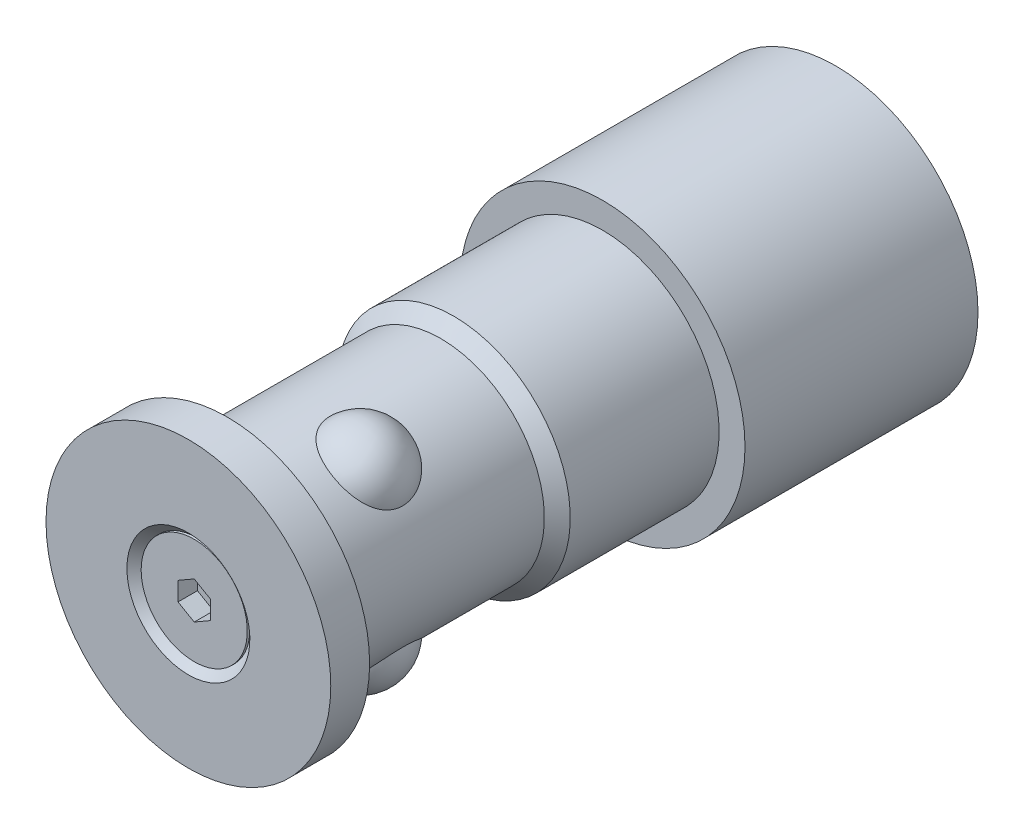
ISO-10303-21;
HEADER;
FILE_DESCRIPTION(('STEP AP214'),'2;1');
FILE_NAME('part.step','',(''),(''),'','','');
FILE_SCHEMA(('AUTOMOTIVE_DESIGN { 1 0 10303 214 1 1 1 1 }'));
ENDSEC;
DATA;
#1=APPLICATION_CONTEXT('core data for automotive mechanical design processes');
#2=APPLICATION_PROTOCOL_DEFINITION('international standard','automotive_design',2000,#1);
#3=PRODUCT_CONTEXT('',#1,'mechanical');
#4=PRODUCT('Part','Part','',(#3));
#5=PRODUCT_RELATED_PRODUCT_CATEGORY('part','',(#4));
#6=PRODUCT_DEFINITION_FORMATION('','',#4);
#7=PRODUCT_DEFINITION_CONTEXT('part definition',#1,'design');
#8=PRODUCT_DEFINITION('design','',#6,#7);
#9=PRODUCT_DEFINITION_SHAPE('','',#8);
#10=(LENGTH_UNIT() NAMED_UNIT(*) SI_UNIT(.MILLI.,.METRE.));
#11=(NAMED_UNIT(*) PLANE_ANGLE_UNIT() SI_UNIT($,.RADIAN.));
#12=(NAMED_UNIT(*) SI_UNIT($,.STERADIAN.) SOLID_ANGLE_UNIT());
#13=UNCERTAINTY_MEASURE_WITH_UNIT(LENGTH_MEASURE(1.E-05),#10,'distance_accuracy_value','');
#14=(GEOMETRIC_REPRESENTATION_CONTEXT(3) GLOBAL_UNCERTAINTY_ASSIGNED_CONTEXT((#13)) GLOBAL_UNIT_ASSIGNED_CONTEXT((#10,
#11,#12)) REPRESENTATION_CONTEXT('',''));
#15=CARTESIAN_POINT('',(0.,0.,0.));
#16=DIRECTION('',(0.,0.,1.));
#17=DIRECTION('',(1.,0.,0.));
#18=AXIS2_PLACEMENT_3D('',#15,#16,#17);
#19=CARTESIAN_POINT('',(-6.32929196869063,0.,-10.1));
#20=DIRECTION('',(0.,0.,1.));
#21=DIRECTION('',(1.,0.,0.));
#22=AXIS2_PLACEMENT_3D('',#19,#20,#21);
#23=SPHERICAL_SURFACE('',#22,3.3734);
#24=CARTESIAN_POINT('',(-7.32152266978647,3.22417521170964,-10.1));
#25=CARTESIAN_POINT('',(-7.32153259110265,3.22416408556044,-9.94866240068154));
#26=CARTESIAN_POINT('',(-7.32702197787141,3.21177565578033,-9.79707288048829));
#27=CARTESIAN_POINT('',(-7.34834214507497,3.16268021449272,-9.49837156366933));
#28=CARTESIAN_POINT('',(-7.36420185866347,3.12590516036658,-9.35127350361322));
#29=CARTESIAN_POINT('',(-7.40429213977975,3.0297089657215,-9.06659153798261));
#30=CARTESIAN_POINT('',(-7.4284889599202,2.97037902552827,-8.92897191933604));
#31=CARTESIAN_POINT('',(-7.48262166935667,2.8312396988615,-8.66590737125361));
#32=CARTESIAN_POINT('',(-7.51255535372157,2.75143817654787,-8.54045779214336));
#33=CARTESIAN_POINT('',(-7.57655429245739,2.57010136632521,-8.29901985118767));
#34=CARTESIAN_POINT('',(-7.61073929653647,2.467803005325,-8.18363829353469));
#35=CARTESIAN_POINT('',(-7.67897376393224,2.24650230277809,-7.9701541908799));
#36=CARTESIAN_POINT('',(-7.71302316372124,2.1274929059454,-7.8720589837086));
#37=CARTESIAN_POINT('',(-7.78141306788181,1.86282208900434,-7.68521630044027));
#38=CARTESIAN_POINT('',(-7.81542884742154,1.71568027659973,-7.59844361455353));
#39=CARTESIAN_POINT('',(-7.87657163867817,1.40859896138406,-7.44824933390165));
#40=CARTESIAN_POINT('',(-7.90369632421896,1.24865516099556,-7.38483562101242));
#41=CARTESIAN_POINT('',(-7.95008741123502,0.90950321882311,-7.27869612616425));
#42=CARTESIAN_POINT('',(-7.9687436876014,0.729716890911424,-7.23754417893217));
#43=CARTESIAN_POINT('',(-7.99375125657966,0.36515988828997,-7.18277355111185));
#44=CARTESIAN_POINT('',(-8.00010084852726,0.180388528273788,-7.16915867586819));
#45=CARTESIAN_POINT('',(-7.99989464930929,-0.19295810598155,-7.1696012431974));
#46=CARTESIAN_POINT('',(-7.99306892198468,-0.3815329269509,-7.18423749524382));
#47=CARTESIAN_POINT('',(-7.96663410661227,-0.753314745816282,-7.24219828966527));
#48=CARTESIAN_POINT('',(-7.9470241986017,-0.936521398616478,-7.28552467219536));
#49=CARTESIAN_POINT('',(-7.89696234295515,-1.29239997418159,-7.40045410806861));
#50=CARTESIAN_POINT('',(-7.86650479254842,-1.46506639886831,-7.47207177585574));
#51=CARTESIAN_POINT('',(-7.79792559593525,-1.79462999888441,-7.6427953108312));
#52=CARTESIAN_POINT('',(-7.75980353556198,-1.95152632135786,-7.74190266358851));
#53=CARTESIAN_POINT('',(-7.68100997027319,-2.24147815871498,-7.96396373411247));
#54=CARTESIAN_POINT('',(-7.64040620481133,-2.37495416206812,-8.08639065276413));
#55=CARTESIAN_POINT('',(-7.56087660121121,-2.61713969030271,-8.35422220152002));
#56=CARTESIAN_POINT('',(-7.52195004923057,-2.72585983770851,-8.49961693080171));
#57=CARTESIAN_POINT('',(-7.45363355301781,-2.90725113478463,-8.79882244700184));
#58=CARTESIAN_POINT('',(-7.42376180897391,-2.98193848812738,-8.9512959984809));
#59=CARTESIAN_POINT('',(-7.3741337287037,-3.10265579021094,-9.26871190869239));
#60=CARTESIAN_POINT('',(-7.35436768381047,-3.14871325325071,-9.43364212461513));
#61=CARTESIAN_POINT('',(-7.32931378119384,-3.20656121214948,-9.75190526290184));
#62=CARTESIAN_POINT('',(-7.32269058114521,-3.22152068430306,-9.90456164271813));
#63=CARTESIAN_POINT('',(-7.32064097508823,-3.22617975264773,-10.2103136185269));
#64=CARTESIAN_POINT('',(-7.32521063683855,-3.21588821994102,-10.3634090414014));
#65=CARTESIAN_POINT('',(-7.34437111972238,-3.17186392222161,-10.6562849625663));
#66=CARTESIAN_POINT('',(-7.35836057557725,-3.1395364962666,-10.7963206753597));
#67=CARTESIAN_POINT('',(-7.39420462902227,-3.05415544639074,-11.0688318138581));
#68=CARTESIAN_POINT('',(-7.41606007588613,-3.00109958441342,-11.2013064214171));
#69=CARTESIAN_POINT('',(-7.46639956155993,-2.87362593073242,-11.4606679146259));
#70=CARTESIAN_POINT('',(-7.49510569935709,-2.79846681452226,-11.5871455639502));
#71=CARTESIAN_POINT('',(-7.55585725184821,-2.63002415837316,-11.8264690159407));
#72=CARTESIAN_POINT('',(-7.58790385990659,-2.53673413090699,-11.9393099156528));
#73=CARTESIAN_POINT('',(-7.65568904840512,-2.32464174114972,-12.1599555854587));
#74=CARTESIAN_POINT('',(-7.69148393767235,-2.20424161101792,-12.2662070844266));
#75=CARTESIAN_POINT('',(-7.76037826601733,-1.94786080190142,-12.4589395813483));
#76=CARTESIAN_POINT('',(-7.79347660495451,-1.81187381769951,-12.5454125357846));
#77=CARTESIAN_POINT('',(-7.85687367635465,-1.5147911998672,-12.7045537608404));
#78=CARTESIAN_POINT('',(-7.88665049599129,-1.35253715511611,-12.7752729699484));
#79=CARTESIAN_POINT('',(-7.93679298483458,-1.0178291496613,-12.8913839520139));
#80=CARTESIAN_POINT('',(-7.95715631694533,-0.845372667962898,-12.9367694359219));
#81=CARTESIAN_POINT('',(-7.98728581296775,-0.486852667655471,-13.0032379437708));
#82=CARTESIAN_POINT('',(-7.99653622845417,-0.300525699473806,-13.0231408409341));
#83=CARTESIAN_POINT('',(-8.00184866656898,0.0731916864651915,-13.0346197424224));
#84=CARTESIAN_POINT('',(-7.99790939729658,0.26058220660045,-13.0261929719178));
#85=CARTESIAN_POINT('',(-7.97711006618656,0.633149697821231,-12.9808555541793));
#86=CARTESIAN_POINT('',(-7.96011619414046,0.818283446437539,-12.9436498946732));
#87=CARTESIAN_POINT('',(-7.9147303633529,1.17902643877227,-12.8407675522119));
#88=CARTESIAN_POINT('',(-7.88633753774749,1.35463495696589,-12.7750887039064));
#89=CARTESIAN_POINT('',(-7.82126240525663,1.69024676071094,-12.6163954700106));
#90=CARTESIAN_POINT('',(-7.78462401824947,1.85032652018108,-12.5235251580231));
#91=CARTESIAN_POINT('',(-7.70699596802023,2.15088707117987,-12.3115052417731));
#92=CARTESIAN_POINT('',(-7.66600695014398,2.29137076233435,-12.1923595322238));
#93=CARTESIAN_POINT('',(-7.58616631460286,2.54300946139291,-11.9346522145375));
#94=CARTESIAN_POINT('',(-7.54729184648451,2.6550598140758,-11.796975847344));
#95=CARTESIAN_POINT('',(-7.47509024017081,2.8520298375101,-11.5020130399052));
#96=CARTESIAN_POINT('',(-7.44176235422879,2.93695316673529,-11.3447292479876));
#97=CARTESIAN_POINT('',(-7.38811773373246,3.06926773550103,-11.0302138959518));
#98=CARTESIAN_POINT('',(-7.36688757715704,3.11938830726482,-10.874302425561));
#99=CARTESIAN_POINT('',(-7.34365136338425,3.17350483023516,-10.6352740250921));
#100=CARTESIAN_POINT('',(-7.33734284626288,3.18802885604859,-10.5548219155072));
#101=CARTESIAN_POINT('',(-7.32777929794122,3.20995461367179,-10.3927890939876));
#102=CARTESIAN_POINT('',(-7.32452198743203,3.21736166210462,-10.3112092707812));
#103=CARTESIAN_POINT('',(-7.32196319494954,3.22317369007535,-10.1863501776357));
#104=CARTESIAN_POINT('',(-7.32151983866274,3.22417838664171,-10.1431853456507));
#105=CARTESIAN_POINT('',(-7.32152266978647,3.22417521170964,-10.1));
#106=B_SPLINE_CURVE_WITH_KNOTS('',3,(#24,#25,#26,#27,#28,#29,#30,#31,#32,#33,#34,#35,#36,#37,
#38,#39,#40,#41,#42,#43,#44,#45,#46,#47,#48,#49,#50,#51,#52,#53,#54,#55,#56,#57,#58,#59,#60,#61,
#62,#63,#64,#65,#66,#67,#68,#69,#70,#71,#72,#73,#74,#75,#76,#77,#78,#79,#80,#81,#82,#83,#84,#85,
#86,#87,#88,#89,#90,#91,#92,#93,#94,#95,#96,#97,#98,#99,#100,#101,#102,#103,#104,#105),
.UNSPECIFIED.,.T.,.F.,(4,2,2,2,2,2,2,2,2,2,2,2,2,2,2,2,2,2,2,2,2,2,2,2,2,2,2,2,2,2,2,2,2,2,2,2,
2,2,2,2,4),(0.,0.453860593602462,0.908992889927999,1.36230410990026,1.81544145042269,
2.28734082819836,2.75944004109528,3.27970525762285,3.80014586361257,4.35371502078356,
4.90736067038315,5.47246989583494,6.03761537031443,6.60305316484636,7.16852152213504,
7.72247280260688,8.27618593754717,8.79045678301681,9.30423262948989,9.76240743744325,
10.2204213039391,10.651663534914,11.0829523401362,11.5307841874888,11.9787765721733,
12.470274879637,12.9619727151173,13.4980272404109,14.0342147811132,14.5944289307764,
15.154697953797,15.7207876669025,16.2869204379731,16.8501062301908,17.4132085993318,
17.955401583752,18.4975214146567,18.9898856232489,19.2355697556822,19.481070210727,
19.6105828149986),.UNSPECIFIED.);
#107=CARTESIAN_POINT('',(-7.32152266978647,3.22417521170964,-10.1));
#108=VERTEX_POINT('',#107);
#109=EDGE_CURVE('E23',#108,#108,#106,.T.);
#110=ORIENTED_EDGE('',*,*,#109,.F.);
#111=EDGE_LOOP('',(#110));
#112=FACE_BOUND('',#111,.T.);
#113=ADVANCED_FACE('F14',(#112),#23,.T.);
#114=CARTESIAN_POINT('',(0.,-1.44337567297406,-1.95));
#115=DIRECTION('',(0.,0.,1.));
#116=DIRECTION('',(-1.,0.,0.));
#117=AXIS2_PLACEMENT_3D('',#114,#115,#116);
#118=PLANE('',#117);
#119=DIRECTION('',(0.866025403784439,-0.5,0.));
#120=VECTOR('',#119,1.);
#121=CARTESIAN_POINT('',(-1.25,-0.721687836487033,-1.95));
#122=LINE('',#121,#120);
#123=CARTESIAN_POINT('',(-1.25,-0.721687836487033,-1.95));
#124=VERTEX_POINT('',#123);
#125=CARTESIAN_POINT('',(0.,-1.44337567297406,-1.95));
#126=VERTEX_POINT('',#125);
#127=EDGE_CURVE('E117',#124,#126,#122,.T.);
#128=ORIENTED_EDGE('',*,*,#127,.T.);
#129=DIRECTION('',(0.866025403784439,0.5,0.));
#130=VECTOR('',#129,1.);
#131=CARTESIAN_POINT('',(0.,-1.44337567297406,-1.95));
#132=LINE('',#131,#130);
#133=CARTESIAN_POINT('',(1.25,-0.721687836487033,-1.95));
#134=VERTEX_POINT('',#133);
#135=EDGE_CURVE('E99',#126,#134,#132,.T.);
#136=ORIENTED_EDGE('',*,*,#135,.T.);
#137=DIRECTION('',(0.,1.,0.));
#138=VECTOR('',#137,1.);
#139=CARTESIAN_POINT('',(1.25,-0.721687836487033,-1.95));
#140=LINE('',#139,#138);
#141=CARTESIAN_POINT('',(1.25,0.721687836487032,-1.95));
#142=VERTEX_POINT('',#141);
#143=EDGE_CURVE('E97',#134,#142,#140,.T.);
#144=ORIENTED_EDGE('',*,*,#143,.T.);
#145=DIRECTION('',(-0.866025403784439,0.5,0.));
#146=VECTOR('',#145,1.);
#147=CARTESIAN_POINT('',(1.25,0.721687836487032,-1.95));
#148=LINE('',#147,#146);
#149=CARTESIAN_POINT('',(0.,1.44337567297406,-1.95));
#150=VERTEX_POINT('',#149);
#151=EDGE_CURVE('E76',#142,#150,#148,.T.);
#152=ORIENTED_EDGE('',*,*,#151,.T.);
#153=DIRECTION('',(-0.866025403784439,-0.5,0.));
#154=VECTOR('',#153,1.);
#155=CARTESIAN_POINT('',(0.,1.44337567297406,-1.95));
#156=LINE('',#155,#154);
#157=CARTESIAN_POINT('',(-1.25,0.721687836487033,-1.95));
#158=VERTEX_POINT('',#157);
#159=EDGE_CURVE('E87',#150,#158,#156,.T.);
#160=ORIENTED_EDGE('',*,*,#159,.T.);
#161=DIRECTION('',(0.,-1.,0.));
#162=VECTOR('',#161,1.);
#163=CARTESIAN_POINT('',(-1.25,0.721687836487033,-1.95));
#164=LINE('',#163,#162);
#165=EDGE_CURVE('E91',#158,#124,#164,.T.);
#166=ORIENTED_EDGE('',*,*,#165,.T.);
#167=EDGE_LOOP('',(#128,#136,#144,#152,#160,#166));
#168=FACE_BOUND('',#167,.T.);
#169=ADVANCED_FACE('F94',(#168),#118,.T.);
#170=CARTESIAN_POINT('',(0.,-1.44337567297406,-1.95));
#171=DIRECTION('',(0.5,-0.866025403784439,0.));
#172=DIRECTION('',(0.866025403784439,0.5,0.));
#173=AXIS2_PLACEMENT_3D('',#170,#171,#172);
#174=PLANE('',#173);
#175=DIRECTION('',(0.866025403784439,0.5,0.));
#176=VECTOR('',#175,1.);
#177=CARTESIAN_POINT('',(0.,-1.44337567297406,-0.45));
#178=LINE('',#177,#176);
#179=CARTESIAN_POINT('',(0.,-1.44337567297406,-0.45));
#180=VERTEX_POINT('',#179);
#181=CARTESIAN_POINT('',(1.25,-0.721687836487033,-0.45));
#182=VERTEX_POINT('',#181);
#183=EDGE_CURVE('E105',#180,#182,#178,.T.);
#184=ORIENTED_EDGE('',*,*,#183,.T.);
#185=DIRECTION('',(0.,0.,1.));
#186=VECTOR('',#185,1.);
#187=CARTESIAN_POINT('',(1.25,-0.721687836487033,-1.95));
#188=LINE('',#187,#186);
#189=EDGE_CURVE('E122',#134,#182,#188,.T.);
#190=ORIENTED_EDGE('',*,*,#189,.F.);
#191=ORIENTED_EDGE('',*,*,#135,.F.);
#192=DIRECTION('',(0.,0.,1.));
#193=VECTOR('',#192,1.);
#194=CARTESIAN_POINT('',(0.,-1.44337567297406,-1.95));
#195=LINE('',#194,#193);
#196=EDGE_CURVE('E61',#126,#180,#195,.T.);
#197=ORIENTED_EDGE('',*,*,#196,.T.);
#198=EDGE_LOOP('',(#184,#190,#191,#197));
#199=FACE_BOUND('',#198,.T.);
#200=ADVANCED_FACE('F197',(#199),#174,.F.);
#201=CARTESIAN_POINT('',(1.25,-0.721687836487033,-1.95));
#202=DIRECTION('',(1.,0.,0.));
#203=DIRECTION('',(0.,0.,1.));
#204=AXIS2_PLACEMENT_3D('',#201,#202,#203);
#205=PLANE('',#204);
#206=DIRECTION('',(0.,1.,0.));
#207=VECTOR('',#206,1.);
#208=CARTESIAN_POINT('',(1.25,-0.721687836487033,-0.45));
#209=LINE('',#208,#207);
#210=CARTESIAN_POINT('',(1.25,0.721687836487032,-0.45));
#211=VERTEX_POINT('',#210);
#212=EDGE_CURVE('E109',#182,#211,#209,.T.);
#213=ORIENTED_EDGE('',*,*,#212,.T.);
#214=DIRECTION('',(0.,0.,1.));
#215=VECTOR('',#214,1.);
#216=CARTESIAN_POINT('',(1.25,0.721687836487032,-1.95));
#217=LINE('',#216,#215);
#218=EDGE_CURVE('E84',#142,#211,#217,.T.);
#219=ORIENTED_EDGE('',*,*,#218,.F.);
#220=ORIENTED_EDGE('',*,*,#143,.F.);
#221=ORIENTED_EDGE('',*,*,#189,.T.);
#222=EDGE_LOOP('',(#213,#219,#220,#221));
#223=FACE_BOUND('',#222,.T.);
#224=ADVANCED_FACE('F204',(#223),#205,.F.);
#225=CARTESIAN_POINT('',(1.25,0.721687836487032,-1.95));
#226=DIRECTION('',(0.5,0.866025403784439,0.));
#227=DIRECTION('',(-0.866025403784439,0.5,0.));
#228=AXIS2_PLACEMENT_3D('',#225,#226,#227);
#229=PLANE('',#228);
#230=DIRECTION('',(-0.866025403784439,0.5,0.));
#231=VECTOR('',#230,1.);
#232=CARTESIAN_POINT('',(1.25,0.721687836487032,-0.45));
#233=LINE('',#232,#231);
#234=CARTESIAN_POINT('',(0.,1.44337567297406,-0.45));
#235=VERTEX_POINT('',#234);
#236=EDGE_CURVE('E79',#211,#235,#233,.T.);
#237=ORIENTED_EDGE('',*,*,#236,.T.);
#238=DIRECTION('',(0.,0.,1.));
#239=VECTOR('',#238,1.);
#240=CARTESIAN_POINT('',(0.,1.44337567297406,-1.95));
#241=LINE('',#240,#239);
#242=EDGE_CURVE('E72',#150,#235,#241,.T.);
#243=ORIENTED_EDGE('',*,*,#242,.F.);
#244=ORIENTED_EDGE('',*,*,#151,.F.);
#245=ORIENTED_EDGE('',*,*,#218,.T.);
#246=EDGE_LOOP('',(#237,#243,#244,#245));
#247=FACE_BOUND('',#246,.T.);
#248=ADVANCED_FACE('F74',(#247),#229,.F.);
#249=CARTESIAN_POINT('',(0.,1.44337567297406,-1.95));
#250=DIRECTION('',(-0.5,0.866025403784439,0.));
#251=DIRECTION('',(-0.866025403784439,-0.5,0.));
#252=AXIS2_PLACEMENT_3D('',#249,#250,#251);
#253=PLANE('',#252);
#254=DIRECTION('',(-0.866025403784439,-0.5,0.));
#255=VECTOR('',#254,1.);
#256=CARTESIAN_POINT('',(0.,1.44337567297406,-0.45));
#257=LINE('',#256,#255);
#258=CARTESIAN_POINT('',(-1.25,0.721687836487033,-0.45));
#259=VERTEX_POINT('',#258);
#260=EDGE_CURVE('E113',#235,#259,#257,.T.);
#261=ORIENTED_EDGE('',*,*,#260,.T.);
#262=DIRECTION('',(0.,0.,1.));
#263=VECTOR('',#262,1.);
#264=CARTESIAN_POINT('',(-1.25,0.721687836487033,-1.95));
#265=LINE('',#264,#263);
#266=EDGE_CURVE('E83',#158,#259,#265,.T.);
#267=ORIENTED_EDGE('',*,*,#266,.F.);
#268=ORIENTED_EDGE('',*,*,#159,.F.);
#269=ORIENTED_EDGE('',*,*,#242,.T.);
#270=EDGE_LOOP('',(#261,#267,#268,#269));
#271=FACE_BOUND('',#270,.T.);
#272=ADVANCED_FACE('F88',(#271),#253,.F.);
#273=CARTESIAN_POINT('',(-1.25,0.721687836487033,-1.95));
#274=DIRECTION('',(-1.,0.,0.));
#275=DIRECTION('',(0.,-1.,0.));
#276=AXIS2_PLACEMENT_3D('',#273,#274,#275);
#277=PLANE('',#276);
#278=DIRECTION('',(0.,-1.,0.));
#279=VECTOR('',#278,1.);
#280=CARTESIAN_POINT('',(-1.25,0.721687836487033,-0.45));
#281=LINE('',#280,#279);
#282=CARTESIAN_POINT('',(-1.25,-0.721687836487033,-0.45));
#283=VERTEX_POINT('',#282);
#284=EDGE_CURVE('E115',#259,#283,#281,.T.);
#285=ORIENTED_EDGE('',*,*,#284,.T.);
#286=DIRECTION('',(0.,0.,1.));
#287=VECTOR('',#286,1.);
#288=CARTESIAN_POINT('',(-1.25,-0.721687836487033,-1.95));
#289=LINE('',#288,#287);
#290=EDGE_CURVE('E39',#124,#283,#289,.T.);
#291=ORIENTED_EDGE('',*,*,#290,.F.);
#292=ORIENTED_EDGE('',*,*,#165,.F.);
#293=ORIENTED_EDGE('',*,*,#266,.T.);
#294=EDGE_LOOP('',(#285,#291,#292,#293));
#295=FACE_BOUND('',#294,.T.);
#296=ADVANCED_FACE('F214',(#295),#277,.F.);
#297=CARTESIAN_POINT('',(-1.25,-0.721687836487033,-1.95));
#298=DIRECTION('',(-0.5,-0.866025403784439,0.));
#299=DIRECTION('',(0.866025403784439,-0.5,0.));
#300=AXIS2_PLACEMENT_3D('',#297,#298,#299);
#301=PLANE('',#300);
#302=DIRECTION('',(0.866025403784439,-0.5,0.));
#303=VECTOR('',#302,1.);
#304=CARTESIAN_POINT('',(-1.25,-0.721687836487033,-0.45));
#305=LINE('',#304,#303);
#306=EDGE_CURVE('E31',#283,#180,#305,.T.);
#307=ORIENTED_EDGE('',*,*,#306,.T.);
#308=ORIENTED_EDGE('',*,*,#196,.F.);
#309=ORIENTED_EDGE('',*,*,#127,.F.);
#310=ORIENTED_EDGE('',*,*,#290,.T.);
#311=EDGE_LOOP('',(#307,#308,#309,#310));
#312=FACE_BOUND('',#311,.T.);
#313=ADVANCED_FACE('F217',(#312),#301,.F.);
#314=CARTESIAN_POINT('',(0.,0.,-0.45));
#315=DIRECTION('',(0.,0.,1.));
#316=DIRECTION('',(-1.,0.,0.));
#317=AXIS2_PLACEMENT_3D('',#314,#315,#316);
#318=PLANE('',#317);
#319=ORIENTED_EDGE('',*,*,#306,.F.);
#320=ORIENTED_EDGE('',*,*,#284,.F.);
#321=ORIENTED_EDGE('',*,*,#260,.F.);
#322=ORIENTED_EDGE('',*,*,#236,.F.);
#323=ORIENTED_EDGE('',*,*,#212,.F.);
#324=ORIENTED_EDGE('',*,*,#183,.F.);
#325=EDGE_LOOP('',(#319,#320,#321,#322,#323,#324));
#326=FACE_BOUND('',#325,.T.);
#327=CARTESIAN_POINT('',(0.,0.,-0.45));
#328=DIRECTION('',(0.,0.,1.));
#329=DIRECTION('',(-1.,0.,0.));
#330=AXIS2_PLACEMENT_3D('',#327,#328,#329);
#331=CIRCLE('',#330,4.1);
#332=CARTESIAN_POINT('',(-4.1,0.,-0.45));
#333=VERTEX_POINT('',#332);
#334=EDGE_CURVE('E127',#333,#333,#331,.T.);
#335=ORIENTED_EDGE('',*,*,#334,.T.);
#336=EDGE_LOOP('',(#335));
#337=FACE_BOUND('',#336,.T.);
#338=ADVANCED_FACE('F227',(#326,#337),#318,.T.);
#339=CARTESIAN_POINT('',(0.,0.,-50.));
#340=DIRECTION('',(0.,0.,-1.));
#341=DIRECTION('',(0.,-1.,0.));
#342=AXIS2_PLACEMENT_3D('',#339,#340,#341);
#343=PLANE('',#342);
#344=CARTESIAN_POINT('',(0.,0.,-50.));
#345=DIRECTION('',(0.,0.,1.));
#346=DIRECTION('',(0.,1.,0.));
#347=AXIS2_PLACEMENT_3D('',#344,#345,#346);
#348=CIRCLE('',#347,7.6);
#349=CARTESIAN_POINT('',(0.,7.6,-50.));
#350=VERTEX_POINT('',#349);
#351=EDGE_CURVE('E146',#350,#350,#348,.T.);
#352=ORIENTED_EDGE('',*,*,#351,.T.);
#353=EDGE_LOOP('',(#352));
#354=FACE_BOUND('',#353,.T.);
#355=CARTESIAN_POINT('',(0.,0.,-50.));
#356=DIRECTION('',(0.,0.,1.));
#357=DIRECTION('',(0.,1.,0.));
#358=AXIS2_PLACEMENT_3D('',#355,#356,#357);
#359=CIRCLE('',#358,11.);
#360=CARTESIAN_POINT('',(0.,11.,-50.));
#361=VERTEX_POINT('',#360);
#362=EDGE_CURVE('E106',#361,#361,#359,.T.);
#363=ORIENTED_EDGE('',*,*,#362,.F.);
#364=EDGE_LOOP('',(#363));
#365=FACE_BOUND('',#364,.T.);
#366=ADVANCED_FACE('F232',(#354,#365),#343,.T.);
#367=CARTESIAN_POINT('',(0.,0.,-0.45));
#368=DIRECTION('',(0.,0.,1.));
#369=DIRECTION('',(-1.,0.,0.));
#370=AXIS2_PLACEMENT_3D('',#367,#368,#369);
#371=CYLINDRICAL_SURFACE('',#370,4.1);
#372=CARTESIAN_POINT('',(0.,0.,-0.65));
#373=DIRECTION('',(0.,0.,1.));
#374=DIRECTION('',(-1.,0.,0.));
#375=AXIS2_PLACEMENT_3D('',#372,#373,#374);
#376=CIRCLE('',#375,4.1);
#377=CARTESIAN_POINT('',(-4.1,0.,-0.65));
#378=VERTEX_POINT('',#377);
#379=EDGE_CURVE('E119',#378,#378,#376,.T.);
#380=ORIENTED_EDGE('',*,*,#379,.T.);
#381=EDGE_LOOP('',(#380));
#382=FACE_BOUND('',#381,.T.);
#383=ORIENTED_EDGE('',*,*,#334,.F.);
#384=EDGE_LOOP('',(#383));
#385=FACE_BOUND('',#384,.T.);
#386=ADVANCED_FACE('F228',(#382,#385),#371,.T.);
#387=CARTESIAN_POINT('',(0.,0.,-3.));
#388=DIRECTION('',(0.,0.,1.));
#389=DIRECTION('',(0.,1.,0.));
#390=AXIS2_PLACEMENT_3D('',#387,#388,#389);
#391=CYLINDRICAL_SURFACE('',#390,11.);
#392=ORIENTED_EDGE('',*,*,#362,.T.);
#393=EDGE_LOOP('',(#392));
#394=FACE_BOUND('',#393,.T.);
#395=CARTESIAN_POINT('',(0.,0.,-32.));
#396=DIRECTION('',(0.,0.,1.));
#397=DIRECTION('',(0.,1.,0.));
#398=AXIS2_PLACEMENT_3D('',#395,#396,#397);
#399=CIRCLE('',#398,11.);
#400=CARTESIAN_POINT('',(0.,11.,-32.));
#401=VERTEX_POINT('',#400);
#402=EDGE_CURVE('E161',#401,#401,#399,.T.);
#403=ORIENTED_EDGE('',*,*,#402,.F.);
#404=EDGE_LOOP('',(#403));
#405=FACE_BOUND('',#404,.T.);
#406=ADVANCED_FACE('F231',(#394,#405),#391,.T.);
#407=CARTESIAN_POINT('',(0.,0.,0.));
#408=DIRECTION('',(0.,0.,1.));
#409=DIRECTION('',(0.,1.,0.));
#410=AXIS2_PLACEMENT_3D('',#407,#408,#409);
#411=CONICAL_SURFACE('',#410,4.75,0.785398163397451);
#412=CARTESIAN_POINT('',(0.,0.,0.));
#413=DIRECTION('',(0.,0.,-1.));
#414=DIRECTION('',(0.,-1.,0.));
#415=AXIS2_PLACEMENT_3D('',#412,#413,#414);
#416=CIRCLE('',#415,4.75);
#417=CARTESIAN_POINT('',(0.,-4.75,0.));
#418=VERTEX_POINT('',#417);
#419=EDGE_CURVE('E168',#418,#418,#416,.T.);
#420=ORIENTED_EDGE('',*,*,#419,.F.);
#421=EDGE_LOOP('',(#420));
#422=FACE_BOUND('',#421,.T.);
#423=ORIENTED_EDGE('',*,*,#379,.F.);
#424=EDGE_LOOP('',(#423));
#425=FACE_BOUND('',#424,.T.);
#426=ADVANCED_FACE('F343',(#422,#425),#411,.F.);
#427=CARTESIAN_POINT('',(-11.,0.,-32.));
#428=DIRECTION('',(0.,0.,1.));
#429=DIRECTION('',(0.,1.,0.));
#430=AXIS2_PLACEMENT_3D('',#427,#428,#429);
#431=PLANE('',#430);
#432=ORIENTED_EDGE('',*,*,#402,.T.);
#433=EDGE_LOOP('',(#432));
#434=FACE_BOUND('',#433,.T.);
#435=CARTESIAN_POINT('',(0.,0.,-32.));
#436=DIRECTION('',(0.,0.,1.));
#437=DIRECTION('',(0.,1.,0.));
#438=AXIS2_PLACEMENT_3D('',#435,#436,#437);
#439=CIRCLE('',#438,9.);
#440=CARTESIAN_POINT('',(0.,9.,-32.));
#441=VERTEX_POINT('',#440);
#442=EDGE_CURVE('E158',#441,#441,#439,.T.);
#443=ORIENTED_EDGE('',*,*,#442,.F.);
#444=EDGE_LOOP('',(#443));
#445=FACE_BOUND('',#444,.T.);
#446=ADVANCED_FACE('F347',(#434,#445),#431,.T.);
#447=CARTESIAN_POINT('',(-2.25,0.,0.));
#448=DIRECTION('',(0.,0.,1.));
#449=DIRECTION('',(0.,1.,0.));
#450=AXIS2_PLACEMENT_3D('',#447,#448,#449);
#451=PLANE('',#450);
#452=ORIENTED_EDGE('',*,*,#419,.T.);
#453=EDGE_LOOP('',(#452));
#454=FACE_BOUND('',#453,.T.);
#455=CARTESIAN_POINT('',(0.,0.,0.));
#456=DIRECTION('',(0.,0.,1.));
#457=DIRECTION('',(0.,1.,0.));
#458=AXIS2_PLACEMENT_3D('',#455,#456,#457);
#459=CIRCLE('',#458,11.);
#460=CARTESIAN_POINT('',(0.,11.,0.));
#461=VERTEX_POINT('',#460);
#462=EDGE_CURVE('E166',#461,#461,#459,.T.);
#463=ORIENTED_EDGE('',*,*,#462,.T.);
#464=EDGE_LOOP('',(#463));
#465=FACE_BOUND('',#464,.T.);
#466=ADVANCED_FACE('F350',(#454,#465),#451,.T.);
#467=CARTESIAN_POINT('',(0.,0.,-3.));
#468=DIRECTION('',(0.,0.,1.));
#469=DIRECTION('',(0.,1.,0.));
#470=AXIS2_PLACEMENT_3D('',#467,#468,#469);
#471=CYLINDRICAL_SURFACE('',#470,9.);
#472=ORIENTED_EDGE('',*,*,#442,.T.);
#473=EDGE_LOOP('',(#472));
#474=FACE_BOUND('',#473,.T.);
#475=CARTESIAN_POINT('',(0.,0.,-20.5));
#476=DIRECTION('',(0.,0.,1.));
#477=DIRECTION('',(0.,1.,0.));
#478=AXIS2_PLACEMENT_3D('',#475,#476,#477);
#479=CIRCLE('',#478,9.);
#480=CARTESIAN_POINT('',(0.,9.,-20.5));
#481=VERTEX_POINT('',#480);
#482=EDGE_CURVE('E155',#481,#481,#479,.T.);
#483=ORIENTED_EDGE('',*,*,#482,.F.);
#484=EDGE_LOOP('',(#483));
#485=FACE_BOUND('',#484,.T.);
#486=ADVANCED_FACE('F354',(#474,#485),#471,.T.);
#487=CARTESIAN_POINT('',(0.,0.,0.));
#488=DIRECTION('',(0.,0.,1.));
#489=DIRECTION('',(0.,1.,0.));
#490=AXIS2_PLACEMENT_3D('',#487,#488,#489);
#491=CYLINDRICAL_SURFACE('',#490,11.);
#492=CARTESIAN_POINT('',(0.,0.,-3.));
#493=DIRECTION('',(0.,0.,1.));
#494=DIRECTION('',(0.,1.,0.));
#495=AXIS2_PLACEMENT_3D('',#492,#493,#494);
#496=CIRCLE('',#495,11.);
#497=CARTESIAN_POINT('',(0.,11.,-3.));
#498=VERTEX_POINT('',#497);
#499=EDGE_CURVE('E18',#498,#498,#496,.T.);
#500=ORIENTED_EDGE('',*,*,#499,.T.);
#501=EDGE_LOOP('',(#500));
#502=FACE_BOUND('',#501,.T.);
#503=ORIENTED_EDGE('',*,*,#462,.F.);
#504=EDGE_LOOP('',(#503));
#505=FACE_BOUND('',#504,.T.);
#506=ADVANCED_FACE('F16',(#502,#505),#491,.T.);
#507=CARTESIAN_POINT('',(0.,0.,-19.5));
#508=DIRECTION('',(0.,0.,-1.));
#509=DIRECTION('',(0.,-1.,0.));
#510=AXIS2_PLACEMENT_3D('',#507,#508,#509);
#511=CONICAL_SURFACE('',#510,8.,0.785398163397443);
#512=ORIENTED_EDGE('',*,*,#482,.T.);
#513=EDGE_LOOP('',(#512));
#514=FACE_BOUND('',#513,.T.);
#515=CARTESIAN_POINT('',(0.,0.,-19.5));
#516=DIRECTION('',(0.,0.,1.));
#517=DIRECTION('',(0.,1.,0.));
#518=AXIS2_PLACEMENT_3D('',#515,#516,#517);
#519=CIRCLE('',#518,8.);
#520=CARTESIAN_POINT('',(0.,8.,-19.5));
#521=VERTEX_POINT('',#520);
#522=EDGE_CURVE('E152',#521,#521,#519,.T.);
#523=ORIENTED_EDGE('',*,*,#522,.F.);
#524=EDGE_LOOP('',(#523));
#525=FACE_BOUND('',#524,.T.);
#526=ADVANCED_FACE('F180',(#514,#525),#511,.T.);
#527=CARTESIAN_POINT('',(-2.25,0.,-3.));
#528=DIRECTION('',(0.,0.,-1.));
#529=DIRECTION('',(0.,-1.,0.));
#530=AXIS2_PLACEMENT_3D('',#527,#528,#529);
#531=PLANE('',#530);
#532=CARTESIAN_POINT('',(0.,0.,-3.));
#533=DIRECTION('',(0.,0.,1.));
#534=DIRECTION('',(0.,1.,0.));
#535=AXIS2_PLACEMENT_3D('',#532,#533,#534);
#536=CIRCLE('',#535,8.);
#537=CARTESIAN_POINT('',(0.,8.,-3.));
#538=VERTEX_POINT('',#537);
#539=EDGE_CURVE('E149',#538,#538,#536,.T.);
#540=ORIENTED_EDGE('',*,*,#539,.T.);
#541=EDGE_LOOP('',(#540));
#542=FACE_BOUND('',#541,.T.);
#543=ORIENTED_EDGE('',*,*,#499,.F.);
#544=EDGE_LOOP('',(#543));
#545=FACE_BOUND('',#544,.T.);
#546=ADVANCED_FACE('F177',(#542,#545),#531,.T.);
#547=CARTESIAN_POINT('',(3.16464598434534,-5.48132763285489,-10.1));
#548=DIRECTION('',(0.,0.,1.));
#549=DIRECTION('',(-0.5,0.866025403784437,0.));
#550=AXIS2_PLACEMENT_3D('',#547,#548,#549);
#551=SPHERICAL_SURFACE('',#550,3.3734);
#552=CARTESIAN_POINT('',(6.45297897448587,-4.7285370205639,-10.1));
#553=CARTESIAN_POINT('',(6.45297429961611,-4.72855117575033,-10.2513375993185));
#554=CARTESIAN_POINT('',(6.44499029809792,-4.73949933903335,-10.4029271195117));
#555=CARTESIAN_POINT('',(6.41313248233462,-4.78251086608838,-10.7016284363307));
#556=CARTESIAN_POINT('',(6.38921420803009,-4.81463330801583,-10.8487264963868));
#557=CARTESIAN_POINT('',(6.3259510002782,-4.89745060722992,-11.1334084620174));
#558=CARTESIAN_POINT('',(6.28666817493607,-4.94807063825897,-11.271028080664));
#559=CARTESIAN_POINT('',(6.19323633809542,-5.06452060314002,-11.5340926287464));
#560=CARTESIAN_POINT('',(6.1390930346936,-5.1303446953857,-11.6595422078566));
#561=CARTESIAN_POINT('',(6.01405021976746,-5.2764378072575,-11.9009801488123));
#562=CARTESIAN_POINT('',(5.9425497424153,-5.35719206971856,-12.0163617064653));
#563=CARTESIAN_POINT('',(5.78501494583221,-5.52693520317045,-12.2298458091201));
#564=CARTESIAN_POINT('',(5.69897448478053,-5.61592754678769,-12.3279410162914));
#565=CARTESIAN_POINT('',(5.50395778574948,-5.80749034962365,-12.5147836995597));
#566=CARTESIAN_POINT('',(5.39353712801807,-5.9105197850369,-12.6015563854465));
#567=CARTESIAN_POINT('',(5.15816830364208,-6.11701165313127,-12.7517506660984));
#568=CARTESIAN_POINT('',(5.03321525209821,-6.2204742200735,-12.8151643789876));
#569=CARTESIAN_POINT('',(4.76269659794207,-6.43022605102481,-12.9213038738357));
#570=CARTESIAN_POINT('',(4.61632520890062,-6.53627602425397,-12.9624558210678));
#571=CARTESIAN_POINT('',(4.31311336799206,-6.74021171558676,-13.0172264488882));
#572=CARTESIAN_POINT('',(4.15627147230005,-6.83809630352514,-13.0308413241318));
#573=CARTESIAN_POINT('',(3.83284070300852,-7.02459104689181,-13.0303987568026));
#574=CARTESIAN_POINT('',(3.66611725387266,-7.11296720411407,-13.0157625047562));
#575=CARTESIAN_POINT('',(3.33092734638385,-7.2759648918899,-12.9578017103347));
#576=CARTESIAN_POINT('',(3.16246077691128,-7.35058553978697,-12.9144753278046));
#577=CARTESIAN_POINT('',(2.829229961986,-7.48516998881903,-12.7995458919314));
#578=CARTESIAN_POINT('',(2.6644676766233,-7.54512618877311,-12.7279282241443));
#579=CARTESIAN_POINT('',(2.34476762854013,-7.65051666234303,-12.5572046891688));
#580=CARTESIAN_POINT('',(2.18983039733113,-7.6959501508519,-12.4580973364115));
#581=CARTESIAN_POINT('',(1.8993279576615,-7.77268884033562,-12.2360362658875));
#582=CARTESIAN_POINT('',(1.76343246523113,-7.80426294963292,-12.1136093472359));
#583=CARTESIAN_POINT('',(1.51392884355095,-7.8564810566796,-11.84577779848));
#584=CARTESIAN_POINT('',(1.40031115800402,-7.87712974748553,-11.7003830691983));
#585=CARTESIAN_POINT('',(1.20906343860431,-7.90866157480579,-11.4011775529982));
#586=CARTESIAN_POINT('',(1.12944642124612,-7.92013556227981,-11.2487040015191));
#587=CARTESIAN_POINT('',(1.00008813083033,-7.93751503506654,-10.9312880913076));
#588=CARTESIAN_POINT('',(0.950318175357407,-7.94342586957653,-10.7663578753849));
#589=CARTESIAN_POINT('',(0.887693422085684,-7.95065253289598,-10.4480947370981));
#590=CARTESIAN_POINT('',(0.871426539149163,-7.95239640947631,-10.2954383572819));
#591=CARTESIAN_POINT('',(0.866366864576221,-7.95295093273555,-9.98968638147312));
#592=CARTESIAN_POINT('',(0.877564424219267,-7.95176260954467,-9.83659095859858));
#593=CARTESIAN_POINT('',(0.925270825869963,-7.94634392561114,-9.54371503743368));
#594=CARTESIAN_POINT('',(0.960261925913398,-7.94229543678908,-9.40367932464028));
#595=CARTESIAN_POINT('',(1.05212611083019,-7.93064677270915,-9.13116818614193));
#596=CARTESIAN_POINT('',(1.10900155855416,-7.92304621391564,-8.99869357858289));
#597=CARTESIAN_POINT('',(1.24456672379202,-7.9029046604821,-8.73933208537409));
#598=CARTESIAN_POINT('',(1.32400949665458,-7.8901853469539,-8.61285443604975));
#599=CARTESIAN_POINT('',(1.50026089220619,-7.858576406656,-8.37353098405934));
#600=CARTESIAN_POINT('',(1.59707572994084,-7.8396845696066,-8.26069008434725));
#601=CARTESIAN_POINT('',(1.81464572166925,-7.79234206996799,-8.04004441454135));
#602=CARTESIAN_POINT('',(1.93681273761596,-7.76314128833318,-7.93379291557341));
#603=CARTESIAN_POINT('',(2.19329219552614,-7.69461512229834,-7.74106041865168));
#604=CARTESIAN_POINT('',(2.32760954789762,-7.65528563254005,-7.65458746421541));
#605=CARTESIAN_POINT('',(2.61658917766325,-7.56164779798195,-7.49544623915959));
#606=CARTESIAN_POINT('',(2.77199371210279,-7.50630825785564,-7.42472703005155));
#607=CARTESIAN_POINT('',(3.08693059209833,-7.3823789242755,-7.30861604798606));
#608=CARTESIAN_POINT('',(3.2464639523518,-7.3137858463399,-7.26323056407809));
#609=CARTESIAN_POINT('',(3.57201612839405,-7.16061875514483,-7.19676205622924));
#610=CARTESIAN_POINT('',(3.73800522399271,-7.07546636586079,-7.17685915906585));
#611=CARTESIAN_POINT('',(4.06431019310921,-6.89320837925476,-7.16538025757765));
#612=CARTESIAN_POINT('',(4.22462550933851,-6.79610161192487,-7.17380702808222));
#613=CARTESIAN_POINT('',(4.53687875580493,-6.59180511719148,-7.21914444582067));
#614=CARTESIAN_POINT('',(4.68871234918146,-6.48452111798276,-7.25635010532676));
#615=CARTESIAN_POINT('',(4.97843202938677,-6.2648443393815,-7.35923244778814));
#616=CARTESIAN_POINT('',(5.11631705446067,-6.15245117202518,-7.42491129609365));
#617=CARTESIAN_POINT('',(5.37442783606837,-5.92828855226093,-7.5836045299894));
#618=CARTESIAN_POINT('',(5.49474178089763,-5.81651889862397,-7.67647484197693));
#619=CARTESIAN_POINT('',(5.71622082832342,-5.5990107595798,-7.88849475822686));
#620=CARTESIAN_POINT('',(5.81738876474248,-5.49327138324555,-8.00764046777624));
#621=CARTESIAN_POINT('',(5.9953939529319,-5.29830801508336,-8.2653477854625));
#622=CARTESIAN_POINT('',(6.07299517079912,-5.20861656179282,-8.40302415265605));
#623=CARTESIAN_POINT('',(6.20747541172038,-5.04760312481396,-8.69798696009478));
#624=CARTESIAN_POINT('',(6.26435722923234,-4.97627866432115,-8.85527075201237));
#625=CARTESIAN_POINT('',(6.35212269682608,-4.86366377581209,-9.16978610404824));
#626=CARTESIAN_POINT('',(6.38491330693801,-4.82021763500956,-9.32569757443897));
#627=CARTESIAN_POINT('',(6.42016148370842,-4.77303622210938,-9.56472597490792));
#628=CARTESIAN_POINT('',(6.42958540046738,-4.76031087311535,-9.64517808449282));
#629=CARTESIAN_POINT('',(6.44379188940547,-4.74106571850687,-9.80721090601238));
#630=CARTESIAN_POINT('',(6.44857792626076,-4.73454128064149,-9.88879072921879));
#631=CARTESIAN_POINT('',(6.45233189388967,-4.72941928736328,-10.0136498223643));
#632=CARTESIAN_POINT('',(6.45298030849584,-4.72853298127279,-10.0568146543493));
#633=CARTESIAN_POINT('',(6.45297897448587,-4.7285370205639,-10.1));
#634=B_SPLINE_CURVE_WITH_KNOTS('',3,(#552,#553,#554,#555,#556,#557,#558,#559,#560,#561,#562,
#563,#564,#565,#566,#567,#568,#569,#570,#571,#572,#573,#574,#575,#576,#577,#578,#579,#580,#581,
#582,#583,#584,#585,#586,#587,#588,#589,#590,#591,#592,#593,#594,#595,#596,#597,#598,#599,#600,
#601,#602,#603,#604,#605,#606,#607,#608,#609,#610,#611,#612,#613,#614,#615,#616,#617,#618,#619,
#620,#621,#622,#623,#624,#625,#626,#627,#628,#629,#630,#631,#632,#633),.UNSPECIFIED.,.T.,.F.,(4,
2,2,2,2,2,2,2,2,2,2,2,2,2,2,2,2,2,2,2,2,2,2,2,2,2,2,2,2,2,2,2,2,2,2,2,2,2,2,2,4),(0.,
0.453860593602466,0.908992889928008,1.36230410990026,1.81544145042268,2.28734082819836,
2.75944004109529,3.27970525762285,3.80014586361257,4.35371502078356,4.90736067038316,
5.47246989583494,6.03761537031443,6.60305316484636,7.16852152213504,7.72247280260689,
8.27618593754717,8.79045678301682,9.3042326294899,9.76240743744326,10.2204213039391,
10.651663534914,11.0829523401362,11.5307841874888,11.9787765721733,12.470274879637,
12.9619727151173,13.4980272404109,14.0342147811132,14.5944289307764,15.154697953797,
15.7207876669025,16.2869204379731,16.8501062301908,17.4132085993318,17.955401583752,
18.4975214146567,18.9898856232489,19.2355697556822,19.481070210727,19.6105828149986),.UNSPECIFIED.);
#635=CARTESIAN_POINT('',(6.45297897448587,-4.7285370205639,-10.1));
#636=VERTEX_POINT('',#635);
#637=EDGE_CURVE('E130',#636,#636,#634,.T.);
#638=ORIENTED_EDGE('',*,*,#637,.F.);
#639=EDGE_LOOP('',(#638));
#640=FACE_BOUND('',#639,.T.);
#641=ADVANCED_FACE('F179',(#640),#551,.T.);
#642=CARTESIAN_POINT('',(3.16464598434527,5.48132763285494,-10.1));
#643=DIRECTION('',(0.,0.,1.));
#644=DIRECTION('',(-0.499999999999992,-0.866025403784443,0.));
#645=AXIS2_PLACEMENT_3D('',#642,#643,#644);
#646=SPHERICAL_SURFACE('',#645,3.3734);
#647=CARTESIAN_POINT('',(6.4529789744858,4.72853702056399,-10.1));
#648=CARTESIAN_POINT('',(6.45297429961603,4.72855117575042,-9.94866240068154));
#649=CARTESIAN_POINT('',(6.44499029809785,4.73949933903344,-9.79707288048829));
#650=CARTESIAN_POINT('',(6.41313248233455,4.78251086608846,-9.49837156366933));
#651=CARTESIAN_POINT('',(6.38921420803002,4.81463330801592,-9.35127350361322));
#652=CARTESIAN_POINT('',(6.32595100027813,4.89745060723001,-9.06659153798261));
#653=CARTESIAN_POINT('',(6.286668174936,4.94807063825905,-8.92897191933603));
#654=CARTESIAN_POINT('',(6.19323633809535,5.06452060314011,-8.66590737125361));
#655=CARTESIAN_POINT('',(6.13909303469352,5.13034469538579,-8.54045779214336));
#656=CARTESIAN_POINT('',(6.01405021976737,5.27643780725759,-8.29901985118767));
#657=CARTESIAN_POINT('',(5.94254974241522,5.35719206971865,-8.18363829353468));
#658=CARTESIAN_POINT('',(5.78501494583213,5.52693520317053,-7.97015419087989));
#659=CARTESIAN_POINT('',(5.69897448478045,5.61592754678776,-7.8720589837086));
#660=CARTESIAN_POINT('',(5.50395778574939,5.80749034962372,-7.68521630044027));
#661=CARTESIAN_POINT('',(5.39353712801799,5.91051978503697,-7.59844361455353));
#662=CARTESIAN_POINT('',(5.158168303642,6.11701165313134,-7.44824933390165));
#663=CARTESIAN_POINT('',(5.03321525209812,6.22047422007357,-7.38483562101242));
#664=CARTESIAN_POINT('',(4.76269659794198,6.43022605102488,-7.27869612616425));
#665=CARTESIAN_POINT('',(4.61632520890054,6.53627602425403,-7.23754417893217));
#666=CARTESIAN_POINT('',(4.31311336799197,6.74021171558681,-7.18277355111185));
#667=CARTESIAN_POINT('',(4.15627147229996,6.83809630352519,-7.16915867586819));
#668=CARTESIAN_POINT('',(3.83284070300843,7.02459104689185,-7.1696012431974));
#669=CARTESIAN_POINT('',(3.66611725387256,7.11296720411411,-7.18423749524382));
#670=CARTESIAN_POINT('',(3.33092734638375,7.27596489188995,-7.24219828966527));
#671=CARTESIAN_POINT('',(3.16246077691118,7.35058553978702,-7.28552467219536));
#672=CARTESIAN_POINT('',(2.8292299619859,7.48516998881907,-7.40045410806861));
#673=CARTESIAN_POINT('',(2.6644676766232,7.54512618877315,-7.47207177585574));
#674=CARTESIAN_POINT('',(2.34476762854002,7.65051666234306,-7.6427953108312));
#675=CARTESIAN_POINT('',(2.18983039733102,7.69595015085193,-7.74190266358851));
#676=CARTESIAN_POINT('',(1.89932795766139,7.77268884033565,-7.96396373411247));
#677=CARTESIAN_POINT('',(1.76343246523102,7.80426294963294,-8.08639065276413));
#678=CARTESIAN_POINT('',(1.51392884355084,7.85648105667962,-8.35422220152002));
#679=CARTESIAN_POINT('',(1.40031115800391,7.87712974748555,-8.49961693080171));
#680=CARTESIAN_POINT('',(1.2090634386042,7.90866157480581,-8.79882244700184));
#681=CARTESIAN_POINT('',(1.12944642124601,7.92013556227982,-8.9512959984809));
#682=CARTESIAN_POINT('',(1.00008813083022,7.93751503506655,-9.26871190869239));
#683=CARTESIAN_POINT('',(0.950318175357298,7.94342586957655,-9.43364212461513));
#684=CARTESIAN_POINT('',(0.887693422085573,7.950652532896,-9.75190526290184));
#685=CARTESIAN_POINT('',(0.871426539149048,7.95239640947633,-9.90456164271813));
#686=CARTESIAN_POINT('',(0.866366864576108,7.95295093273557,-10.2103136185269));
#687=CARTESIAN_POINT('',(0.877564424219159,7.95176260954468,-10.3634090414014));
#688=CARTESIAN_POINT('',(0.925270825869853,7.94634392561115,-10.6562849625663));
#689=CARTESIAN_POINT('',(0.960261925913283,7.94229543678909,-10.7963206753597));
#690=CARTESIAN_POINT('',(1.05212611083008,7.93064677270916,-11.0688318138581));
#691=CARTESIAN_POINT('',(1.10900155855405,7.92304621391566,-11.2013064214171));
#692=CARTESIAN_POINT('',(1.24456672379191,7.90290466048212,-11.4606679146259));
#693=CARTESIAN_POINT('',(1.32400949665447,7.89018534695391,-11.5871455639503));
#694=CARTESIAN_POINT('',(1.50026089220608,7.85857640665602,-11.8264690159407));
#695=CARTESIAN_POINT('',(1.59707572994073,7.83968456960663,-11.9393099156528));
#696=CARTESIAN_POINT('',(1.81464572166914,7.79234206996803,-12.1599555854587));
#697=CARTESIAN_POINT('',(1.93681273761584,7.76314128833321,-12.2662070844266));
#698=CARTESIAN_POINT('',(2.19329219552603,7.69461512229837,-12.4589395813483));
#699=CARTESIAN_POINT('',(2.32760954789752,7.65528563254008,-12.5454125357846));
#700=CARTESIAN_POINT('',(2.61658917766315,7.56164779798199,-12.7045537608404));
#701=CARTESIAN_POINT('',(2.77199371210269,7.50630825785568,-12.7752729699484));
#702=CARTESIAN_POINT('',(3.08693059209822,7.38237892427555,-12.8913839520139));
#703=CARTESIAN_POINT('',(3.2464639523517,7.31378584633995,-12.9367694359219));
#704=CARTESIAN_POINT('',(3.57201612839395,7.16061875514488,-13.0032379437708));
#705=CARTESIAN_POINT('',(3.73800522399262,7.07546636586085,-13.0231408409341));
#706=CARTESIAN_POINT('',(4.06431019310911,6.89320837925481,-13.0346197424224));
#707=CARTESIAN_POINT('',(4.22462550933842,6.79610161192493,-13.0261929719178));
#708=CARTESIAN_POINT('',(4.53687875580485,6.59180511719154,-12.9808555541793));
#709=CARTESIAN_POINT('',(4.68871234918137,6.48452111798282,-12.9436498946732));
#710=CARTESIAN_POINT('',(4.97843202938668,6.26484433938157,-12.8407675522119));
#711=CARTESIAN_POINT('',(5.11631705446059,6.15245117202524,-12.7750887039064));
#712=CARTESIAN_POINT('',(5.3744278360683,5.928288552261,-12.6163954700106));
#713=CARTESIAN_POINT('',(5.49474178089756,5.81651889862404,-12.5235251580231));
#714=CARTESIAN_POINT('',(5.71622082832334,5.59901075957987,-12.3115052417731));
#715=CARTESIAN_POINT('',(5.8173887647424,5.49327138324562,-12.1923595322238));
#716=CARTESIAN_POINT('',(5.99539395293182,5.29830801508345,-11.9346522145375));
#717=CARTESIAN_POINT('',(6.07299517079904,5.2086165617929,-11.796975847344));
#718=CARTESIAN_POINT('',(6.20747541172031,5.04760312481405,-11.5020130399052));
#719=CARTESIAN_POINT('',(6.26435722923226,4.97627866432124,-11.3447292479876));
#720=CARTESIAN_POINT('',(6.35212269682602,4.86366377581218,-11.0302138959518));
#721=CARTESIAN_POINT('',(6.38491330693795,4.82021763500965,-10.874302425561));
#722=CARTESIAN_POINT('',(6.42016148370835,4.77303622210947,-10.6352740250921));
#723=CARTESIAN_POINT('',(6.42958540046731,4.76031087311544,-10.5548219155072));
#724=CARTESIAN_POINT('',(6.44379188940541,4.74106571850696,-10.3927890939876));
#725=CARTESIAN_POINT('',(6.4485779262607,4.73454128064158,-10.3112092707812));
#726=CARTESIAN_POINT('',(6.45233189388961,4.72941928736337,-10.1863501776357));
#727=CARTESIAN_POINT('',(6.45298030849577,4.72853298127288,-10.1431853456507));
#728=CARTESIAN_POINT('',(6.4529789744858,4.72853702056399,-10.1));
#729=B_SPLINE_CURVE_WITH_KNOTS('',3,(#647,#648,#649,#650,#651,#652,#653,#654,#655,#656,#657,
#658,#659,#660,#661,#662,#663,#664,#665,#666,#667,#668,#669,#670,#671,#672,#673,#674,#675,#676,
#677,#678,#679,#680,#681,#682,#683,#684,#685,#686,#687,#688,#689,#690,#691,#692,#693,#694,#695,
#696,#697,#698,#699,#700,#701,#702,#703,#704,#705,#706,#707,#708,#709,#710,#711,#712,#713,#714,
#715,#716,#717,#718,#719,#720,#721,#722,#723,#724,#725,#726,#727,#728),.UNSPECIFIED.,.T.,.F.,(4,
2,2,2,2,2,2,2,2,2,2,2,2,2,2,2,2,2,2,2,2,2,2,2,2,2,2,2,2,2,2,2,2,2,2,2,2,2,2,2,4),(0.,
0.453860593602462,0.908992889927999,1.36230410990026,1.81544145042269,2.28734082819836,
2.75944004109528,3.27970525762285,3.80014586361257,4.35371502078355,4.90736067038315,
5.47246989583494,6.03761537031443,6.60305316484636,7.16852152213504,7.72247280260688,
8.27618593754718,8.79045678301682,9.3042326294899,9.76240743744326,10.2204213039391,
10.651663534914,11.0829523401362,11.5307841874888,11.9787765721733,12.470274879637,
12.9619727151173,13.4980272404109,14.0342147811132,14.5944289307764,15.154697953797,
15.7207876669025,16.2869204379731,16.8501062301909,17.4132085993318,17.955401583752,
18.4975214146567,18.9898856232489,19.2355697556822,19.481070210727,19.6105828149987),.UNSPECIFIED.);
#730=CARTESIAN_POINT('',(6.4529789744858,4.72853702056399,-10.1));
#731=VERTEX_POINT('',#730);
#732=EDGE_CURVE('E265',#731,#731,#729,.T.);
#733=ORIENTED_EDGE('',*,*,#732,.F.);
#734=EDGE_LOOP('',(#733));
#735=FACE_BOUND('',#734,.T.);
#736=ADVANCED_FACE('F189',(#735),#646,.T.);
#737=CARTESIAN_POINT('',(0.,0.,-3.));
#738=DIRECTION('',(0.,0.,1.));
#739=DIRECTION('',(0.,1.,0.));
#740=AXIS2_PLACEMENT_3D('',#737,#738,#739);
#741=CYLINDRICAL_SURFACE('',#740,8.);
#742=ORIENTED_EDGE('',*,*,#109,.T.);
#743=EDGE_LOOP('',(#742));
#744=FACE_BOUND('',#743,.T.);
#745=ORIENTED_EDGE('',*,*,#732,.T.);
#746=EDGE_LOOP('',(#745));
#747=FACE_BOUND('',#746,.T.);
#748=ORIENTED_EDGE('',*,*,#637,.T.);
#749=EDGE_LOOP('',(#748));
#750=FACE_BOUND('',#749,.T.);
#751=ORIENTED_EDGE('',*,*,#539,.F.);
#752=EDGE_LOOP('',(#751));
#753=FACE_BOUND('',#752,.T.);
#754=ORIENTED_EDGE('',*,*,#522,.T.);
#755=EDGE_LOOP('',(#754));
#756=FACE_BOUND('',#755,.T.);
#757=ADVANCED_FACE('F276',(#744,#747,#750,#753,#756),#741,.T.);
#758=CARTESIAN_POINT('',(0.,0.,-3.));
#759=DIRECTION('',(0.,0.,1.));
#760=DIRECTION('',(0.,1.,0.));
#761=AXIS2_PLACEMENT_3D('',#758,#759,#760);
#762=CYLINDRICAL_SURFACE('',#761,7.6);
#763=ORIENTED_EDGE('',*,*,#351,.F.);
#764=EDGE_LOOP('',(#763));
#765=FACE_BOUND('',#764,.T.);
#766=CARTESIAN_POINT('',(0.,0.,-35.7));
#767=DIRECTION('',(0.,0.,1.));
#768=DIRECTION('',(0.,1.,0.));
#769=AXIS2_PLACEMENT_3D('',#766,#767,#768);
#770=CIRCLE('',#769,7.6);
#771=CARTESIAN_POINT('',(0.,7.6,-35.7));
#772=VERTEX_POINT('',#771);
#773=EDGE_CURVE('E143',#772,#772,#770,.T.);
#774=ORIENTED_EDGE('',*,*,#773,.T.);
#775=EDGE_LOOP('',(#774));
#776=FACE_BOUND('',#775,.T.);
#777=ADVANCED_FACE('F288',(#765,#776),#762,.F.);
#778=CARTESIAN_POINT('',(-7.6,0.,-35.7));
#779=DIRECTION('',(0.,0.,1.));
#780=DIRECTION('',(0.,1.,0.));
#781=AXIS2_PLACEMENT_3D('',#778,#779,#780);
#782=PLANE('',#781);
#783=ORIENTED_EDGE('',*,*,#773,.F.);
#784=EDGE_LOOP('',(#783));
#785=FACE_BOUND('',#784,.T.);
#786=CARTESIAN_POINT('',(0.,0.,-35.7));
#787=DIRECTION('',(0.,0.,-1.));
#788=DIRECTION('',(0.,-1.,0.));
#789=AXIS2_PLACEMENT_3D('',#786,#787,#788);
#790=CIRCLE('',#789,6.25);
#791=CARTESIAN_POINT('',(0.,-6.25,-35.7));
#792=VERTEX_POINT('',#791);
#793=EDGE_CURVE('E131',#792,#792,#790,.T.);
#794=ORIENTED_EDGE('',*,*,#793,.F.);
#795=EDGE_LOOP('',(#794));
#796=FACE_BOUND('',#795,.T.);
#797=ADVANCED_FACE('F319',(#785,#796),#782,.F.);
#798=CARTESIAN_POINT('',(0.,0.,-3.));
#799=DIRECTION('',(0.,0.,1.));
#800=DIRECTION('',(0.,1.,0.));
#801=AXIS2_PLACEMENT_3D('',#798,#799,#800);
#802=CYLINDRICAL_SURFACE('',#801,6.25);
#803=CARTESIAN_POINT('',(0.,0.,-16.2));
#804=DIRECTION('',(0.,0.,1.));
#805=DIRECTION('',(0.,1.,0.));
#806=AXIS2_PLACEMENT_3D('',#803,#804,#805);
#807=CIRCLE('',#806,6.25);
#808=CARTESIAN_POINT('',(0.,6.25,-16.2));
#809=VERTEX_POINT('',#808);
#810=EDGE_CURVE('E140',#809,#809,#807,.T.);
#811=ORIENTED_EDGE('',*,*,#810,.T.);
#812=EDGE_LOOP('',(#811));
#813=FACE_BOUND('',#812,.T.);
#814=ORIENTED_EDGE('',*,*,#793,.T.);
#815=EDGE_LOOP('',(#814));
#816=FACE_BOUND('',#815,.T.);
#817=ADVANCED_FACE('F241',(#813,#816),#802,.F.);
#818=CARTESIAN_POINT('',(-4.25,0.,-6.));
#819=DIRECTION('',(0.,0.,1.));
#820=DIRECTION('',(0.,1.,0.));
#821=AXIS2_PLACEMENT_3D('',#818,#819,#820);
#822=PLANE('',#821);
#823=CARTESIAN_POINT('',(0.,0.,-6.));
#824=DIRECTION('',(0.,0.,1.));
#825=DIRECTION('',(0.,1.,0.));
#826=AXIS2_PLACEMENT_3D('',#823,#824,#825);
#827=CIRCLE('',#826,4.25);
#828=CARTESIAN_POINT('',(0.,4.25,-6.));
#829=VERTEX_POINT('',#828);
#830=EDGE_CURVE('E134',#829,#829,#827,.T.);
#831=ORIENTED_EDGE('',*,*,#830,.F.);
#832=EDGE_LOOP('',(#831));
#833=FACE_BOUND('',#832,.T.);
#834=ADVANCED_FACE('F237',(#833),#822,.F.);
#835=CARTESIAN_POINT('',(-6.25,0.,-16.2));
#836=DIRECTION('',(0.,0.,1.));
#837=DIRECTION('',(0.,1.,0.));
#838=AXIS2_PLACEMENT_3D('',#835,#836,#837);
#839=PLANE('',#838);
#840=ORIENTED_EDGE('',*,*,#810,.F.);
#841=EDGE_LOOP('',(#840));
#842=FACE_BOUND('',#841,.T.);
#843=CARTESIAN_POINT('',(0.,0.,-16.2));
#844=DIRECTION('',(0.,0.,1.));
#845=DIRECTION('',(0.,1.,0.));
#846=AXIS2_PLACEMENT_3D('',#843,#844,#845);
#847=CIRCLE('',#846,4.25);
#848=CARTESIAN_POINT('',(0.,4.25,-16.2));
#849=VERTEX_POINT('',#848);
#850=EDGE_CURVE('E137',#849,#849,#847,.T.);
#851=ORIENTED_EDGE('',*,*,#850,.T.);
#852=EDGE_LOOP('',(#851));
#853=FACE_BOUND('',#852,.T.);
#854=ADVANCED_FACE('F240',(#842,#853),#839,.F.);
#855=CARTESIAN_POINT('',(3.66853604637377,-2.14577335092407,-10.1));
#856=CARTESIAN_POINT('',(3.66854029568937,-2.14577910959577,-10.2666234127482));
#857=CARTESIAN_POINT('',(3.66187056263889,-2.1572966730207,-10.4334640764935));
#858=CARTESIAN_POINT('',(3.63453325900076,-2.20303487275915,-10.7631937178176));
#859=CARTESIAN_POINT('',(3.61382975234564,-2.23731378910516,-10.9260714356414));
#860=CARTESIAN_POINT('',(3.5564461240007,-2.32745826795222,-11.2434835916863));
#861=CARTESIAN_POINT('',(3.51971405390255,-2.38339395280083,-11.3979890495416));
#862=CARTESIAN_POINT('',(3.42735485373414,-2.51438449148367,-11.6925007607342));
#863=CARTESIAN_POINT('',(3.37176375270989,-2.58940282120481,-11.832534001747));
#864=CARTESIAN_POINT('',(3.25675766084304,-2.73164815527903,-12.05584963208));
#865=CARTESIAN_POINT('',(3.20262441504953,-2.7953191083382,-12.1441330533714));
#866=CARTESIAN_POINT('',(3.08156106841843,-2.92822986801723,-12.3066364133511));
#867=CARTESIAN_POINT('',(3.01464758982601,-2.99746237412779,-12.3808743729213));
#868=CARTESIAN_POINT('',(2.87911954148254,-3.12738585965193,-12.5016042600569));
#869=CARTESIAN_POINT('',(2.81241428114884,-3.18771547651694,-12.5506210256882));
#870=CARTESIAN_POINT('',(2.67001354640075,-3.30789728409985,-12.6341219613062));
#871=CARTESIAN_POINT('',(2.59432193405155,-3.36774966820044,-12.6686123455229));
#872=CARTESIAN_POINT('',(2.43487710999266,-3.48477957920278,-12.7213715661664));
#873=CARTESIAN_POINT('',(2.35108538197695,-3.5419421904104,-12.7395582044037));
#874=CARTESIAN_POINT('',(2.17816365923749,-3.650825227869,-12.7582811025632));
#875=CARTESIAN_POINT('',(2.08903549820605,-3.70254750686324,-12.7588233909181));
#876=CARTESIAN_POINT('',(1.91655543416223,-3.79447312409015,-12.7429857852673));
#877=CARTESIAN_POINT('',(1.8333877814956,-3.83529016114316,-12.7280948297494));
#878=CARTESIAN_POINT('',(1.66769979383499,-3.91018502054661,-12.6844211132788));
#879=CARTESIAN_POINT('',(1.5851794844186,-3.94426257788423,-12.655637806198));
#880=CARTESIAN_POINT('',(1.42107888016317,-4.00636102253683,-12.5846427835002));
#881=CARTESIAN_POINT('',(1.33957060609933,-4.03421390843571,-12.5421206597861));
#882=CARTESIAN_POINT('',(1.18154606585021,-4.08329622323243,-12.445599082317));
#883=CARTESIAN_POINT('',(1.10503167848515,-4.10452317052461,-12.3915953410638));
#884=CARTESIAN_POINT('',(0.948392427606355,-4.14372255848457,-12.2658046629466));
#885=CARTESIAN_POINT('',(0.869202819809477,-4.16085397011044,-12.1925961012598));
#886=CARTESIAN_POINT('',(0.720466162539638,-4.18917312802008,-12.0359840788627));
#887=CARTESIAN_POINT('',(0.650924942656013,-4.20035729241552,-11.9525745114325));
#888=CARTESIAN_POINT('',(0.509719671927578,-4.22003878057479,-11.7605098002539));
#889=CARTESIAN_POINT('',(0.440299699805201,-4.22758302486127,-11.650107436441));
#890=CARTESIAN_POINT('',(0.317151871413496,-4.23860071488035,-11.4206999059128));
#891=CARTESIAN_POINT('',(0.263434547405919,-4.24207143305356,-11.301689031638));
#892=CARTESIAN_POINT('',(0.163498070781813,-4.2472048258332,-11.0347674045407));
#893=CARTESIAN_POINT('',(0.120558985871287,-4.24840808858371,-10.8856137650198));
#894=CARTESIAN_POINT('',(0.0575372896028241,-4.24972592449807,-10.5825490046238));
#895=CARTESIAN_POINT('',(0.0374658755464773,-4.24983996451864,-10.4286355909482));
#896=CARTESIAN_POINT('',(0.0193124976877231,-4.24997085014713,-10.1023765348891));
#897=CARTESIAN_POINT('',(0.0239092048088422,-4.24997554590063,-9.92987567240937));
#898=CARTESIAN_POINT('',(0.0614235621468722,-4.24959610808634,-9.58784661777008));
#899=CARTESIAN_POINT('',(0.0943619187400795,-4.24921169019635,-9.41832069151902));
#900=CARTESIAN_POINT('',(0.189272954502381,-4.24605477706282,-9.08422738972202));
#901=CARTESIAN_POINT('',(0.251760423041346,-4.24323917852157,-8.91980532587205));
#902=CARTESIAN_POINT('',(0.405403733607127,-4.23131894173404,-8.60519015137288));
#903=CARTESIAN_POINT('',(0.496515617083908,-4.22222392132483,-8.45497567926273));
#904=CARTESIAN_POINT('',(0.675359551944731,-4.19666382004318,-8.21626770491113));
#905=CARTESIAN_POINT('',(0.756467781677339,-4.18308596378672,-8.12247824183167));
#906=CARTESIAN_POINT('',(0.930939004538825,-4.14773983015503,-7.94887961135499));
#907=CARTESIAN_POINT('',(1.02428412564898,-4.12598341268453,-7.8690504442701));
#908=CARTESIAN_POINT('',(1.20476371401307,-4.07655449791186,-7.73862232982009));
#909=CARTESIAN_POINT('',(1.29040626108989,-4.05043732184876,-7.68537672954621));
#910=CARTESIAN_POINT('',(1.46653403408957,-3.99004029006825,-7.59339460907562));
#911=CARTESIAN_POINT('',(1.55701729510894,-3.95576372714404,-7.55465225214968));
#912=CARTESIAN_POINT('',(1.74052372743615,-3.87853415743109,-7.49353477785));
#913=CARTESIAN_POINT('',(1.83355833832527,-3.83553334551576,-7.47125312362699));
#914=CARTESIAN_POINT('',(2.0182205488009,-3.74165606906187,-7.44482218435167));
#915=CARTESIAN_POINT('',(2.10984877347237,-3.69078322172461,-7.44066459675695));
#916=CARTESIAN_POINT('',(2.27944673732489,-3.58824049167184,-7.45022180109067));
#917=CARTESIAN_POINT('',(2.35787046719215,-3.53714848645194,-7.46220740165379));
#918=CARTESIAN_POINT('',(2.50881812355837,-3.43173536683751,-7.50043720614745));
#919=CARTESIAN_POINT('',(2.58134208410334,-3.37741427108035,-7.5266813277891));
#920=CARTESIAN_POINT('',(2.7198641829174,-3.26692265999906,-7.59252367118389));
#921=CARTESIAN_POINT('',(2.78578472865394,-3.21073862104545,-7.63226092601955));
#922=CARTESIAN_POINT('',(2.90957928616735,-3.09900216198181,-7.72337818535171));
#923=CARTESIAN_POINT('',(2.96745040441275,-3.04344997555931,-7.77476235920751));
#924=CARTESIAN_POINT('',(3.0819604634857,-2.92770779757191,-7.89466641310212));
#925=CARTESIAN_POINT('',(3.13749728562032,-2.86783208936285,-7.96453684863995));
#926=CARTESIAN_POINT('',(3.23875984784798,-2.75296367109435,-8.11458441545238));
#927=CARTESIAN_POINT('',(3.28448067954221,-2.69797341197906,-8.19476667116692));
#928=CARTESIAN_POINT('',(3.3748623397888,-2.5843855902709,-8.37962567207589));
#929=CARTESIAN_POINT('',(3.41763086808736,-2.52712571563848,-8.48604839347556));
#930=CARTESIAN_POINT('',(3.49193417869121,-2.42342080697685,-8.70776765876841));
#931=CARTESIAN_POINT('',(3.52345654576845,-2.37698774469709,-8.82307383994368));
#932=CARTESIAN_POINT('',(3.58173406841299,-2.28845550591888,-9.08280026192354));
#933=CARTESIAN_POINT('',(3.60640878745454,-2.24890420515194,-9.22855697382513));
#934=CARTESIAN_POINT('',(3.64344362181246,-2.18839677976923,-9.52519605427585));
#935=CARTESIAN_POINT('',(3.6558211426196,-2.16741437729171,-9.67607086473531));
#936=CARTESIAN_POINT('',(3.66454039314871,-2.15259100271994,-9.87302643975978));
#937=CARTESIAN_POINT('',(3.66604015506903,-2.1500359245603,-9.91836881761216));
#938=CARTESIAN_POINT('',(3.66803736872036,-2.14662637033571,-10.0091354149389));
#939=CARTESIAN_POINT('',(3.66853488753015,-2.14577178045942,-10.0545596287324));
#940=CARTESIAN_POINT('',(3.66853604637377,-2.14577335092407,-10.1));
#941=B_SPLINE_CURVE_WITH_KNOTS('',3,(#855,#856,#857,#858,#859,#860,#861,#862,#863,#864,#865,
#866,#867,#868,#869,#870,#871,#872,#873,#874,#875,#876,#877,#878,#879,#880,#881,#882,#883,#884,
#885,#886,#887,#888,#889,#890,#891,#892,#893,#894,#895,#896,#897,#898,#899,#900,#901,#902,#903,
#904,#905,#906,#907,#908,#909,#910,#911,#912,#913,#914,#915,#916,#917,#918,#919,#920,#921,#922,
#923,#924,#925,#926,#927,#928,#929,#930,#931,#932,#933,#934,#935,#936,#937,#938,#939,#940),
.UNSPECIFIED.,.T.,.F.,(4,2,2,2,2,2,2,2,2,2,2,2,2,2,2,2,2,2,2,2,2,2,2,2,2,2,2,2,2,2,2,2,2,2,2,2,
2,2,2,2,2,2,4),(0.,0.499714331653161,1.00071313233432,1.50334786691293,2.00502770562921,
2.36836543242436,2.73123377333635,3.0372455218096,3.34312622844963,3.6505405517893,
3.95784984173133,4.23804311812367,4.51824741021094,4.80528615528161,5.09243227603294,
5.41881454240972,5.74539315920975,6.13583364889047,6.52653542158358,6.99029089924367,
7.45427336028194,7.96959188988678,8.48528723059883,9.01031775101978,9.53454589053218,
9.90736959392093,10.2796547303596,10.5908872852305,10.9019944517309,11.2148547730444,
11.5275717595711,11.8093192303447,12.0910650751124,12.3758068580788,12.6606507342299,
12.9818878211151,13.3032851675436,13.6864482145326,14.0700329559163,14.5273362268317,
14.9839913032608,15.120279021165,15.2565576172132),.UNSPECIFIED.);
#942=CARTESIAN_POINT('',(3.66853604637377,-2.14577335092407,-10.1));
#943=VERTEX_POINT('',#942);
#944=EDGE_CURVE('E252',#943,#943,#941,.T.);
#945=ORIENTED_EDGE('',*,*,#944,.T.);
#946=EDGE_LOOP('',(#945));
#947=FACE_BOUND('',#946,.T.);
#948=ADVANCED_FACE('F192',(#947),#551,.T.);
#949=CARTESIAN_POINT('',(3.66853604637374,2.14577335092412,-10.1));
#950=CARTESIAN_POINT('',(3.66854029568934,2.14577910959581,-9.93337658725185));
#951=CARTESIAN_POINT('',(3.66187056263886,2.15729667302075,-9.76653592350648));
#952=CARTESIAN_POINT('',(3.63453325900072,2.20303487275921,-9.43680628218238));
#953=CARTESIAN_POINT('',(3.61382975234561,2.23731378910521,-9.27392856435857));
#954=CARTESIAN_POINT('',(3.55644612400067,2.32745826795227,-8.95651640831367));
#955=CARTESIAN_POINT('',(3.51971405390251,2.38339395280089,-8.80201095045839));
#956=CARTESIAN_POINT('',(3.4273548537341,2.51438449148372,-8.50749923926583));
#957=CARTESIAN_POINT('',(3.37176375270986,2.58940282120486,-8.36746599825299));
#958=CARTESIAN_POINT('',(3.25675766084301,2.73164815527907,-8.14415036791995));
#959=CARTESIAN_POINT('',(3.20262441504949,2.79531910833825,-8.05586694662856));
#960=CARTESIAN_POINT('',(3.08156106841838,2.92822986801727,-7.89336358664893));
#961=CARTESIAN_POINT('',(3.01464758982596,2.99746237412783,-7.81912562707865));
#962=CARTESIAN_POINT('',(2.87911954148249,3.12738585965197,-7.69839573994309));
#963=CARTESIAN_POINT('',(2.81241428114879,3.18771547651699,-7.64937897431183));
#964=CARTESIAN_POINT('',(2.67001354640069,3.30789728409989,-7.5658780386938));
#965=CARTESIAN_POINT('',(2.5943219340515,3.36774966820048,-7.53138765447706));
#966=CARTESIAN_POINT('',(2.43487710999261,3.48477957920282,-7.47862843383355));
#967=CARTESIAN_POINT('',(2.3510853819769,3.54194219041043,-7.46044179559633));
#968=CARTESIAN_POINT('',(2.17816365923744,3.65082522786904,-7.44171889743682));
#969=CARTESIAN_POINT('',(2.089035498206,3.70254750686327,-7.44117660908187));
#970=CARTESIAN_POINT('',(1.91655543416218,3.79447312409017,-7.45701421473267));
#971=CARTESIAN_POINT('',(1.83338778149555,3.83529016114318,-7.47190517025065));
#972=CARTESIAN_POINT('',(1.66769979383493,3.91018502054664,-7.5155788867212));
#973=CARTESIAN_POINT('',(1.58517948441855,3.94426257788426,-7.54436219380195));
#974=CARTESIAN_POINT('',(1.42107888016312,4.00636102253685,-7.61535721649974));
#975=CARTESIAN_POINT('',(1.33957060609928,4.03421390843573,-7.65787934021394));
#976=CARTESIAN_POINT('',(1.18154606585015,4.08329622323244,-7.75440091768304));
#977=CARTESIAN_POINT('',(1.10503167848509,4.10452317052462,-7.80840465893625));
#978=CARTESIAN_POINT('',(0.948392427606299,4.14372255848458,-7.93419533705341));
#979=CARTESIAN_POINT('',(0.869202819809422,4.16085397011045,-8.00740389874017));
#980=CARTESIAN_POINT('',(0.720466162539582,4.18917312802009,-8.16401592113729));
#981=CARTESIAN_POINT('',(0.650924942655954,4.20035729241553,-8.24742548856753));
#982=CARTESIAN_POINT('',(0.509719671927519,4.22003878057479,-8.43949019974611));
#983=CARTESIAN_POINT('',(0.440299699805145,4.22758302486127,-8.549892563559));
#984=CARTESIAN_POINT('',(0.317151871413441,4.23860071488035,-8.7793000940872));
#985=CARTESIAN_POINT('',(0.26343454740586,4.24207143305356,-8.89831096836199));
#986=CARTESIAN_POINT('',(0.163498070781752,4.24720482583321,-9.16523259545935));
#987=CARTESIAN_POINT('',(0.12055898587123,4.24840808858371,-9.31438623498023));
#988=CARTESIAN_POINT('',(0.0575372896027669,4.24972592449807,-9.61745099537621));
#989=CARTESIAN_POINT('',(0.0374658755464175,4.24983996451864,-9.77136440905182));
#990=CARTESIAN_POINT('',(0.0193124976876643,4.24997085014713,-10.0976234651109));
#991=CARTESIAN_POINT('',(0.0239092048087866,4.24997554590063,-10.2701243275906));
#992=CARTESIAN_POINT('',(0.061423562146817,4.24959610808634,-10.6121533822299));
#993=CARTESIAN_POINT('',(0.0943619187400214,4.24921169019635,-10.781679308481));
#994=CARTESIAN_POINT('',(0.189272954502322,4.24605477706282,-11.115772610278));
#995=CARTESIAN_POINT('',(0.25176042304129,4.24323917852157,-11.2801946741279));
#996=CARTESIAN_POINT('',(0.405403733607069,4.23131894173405,-11.5948098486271));
#997=CARTESIAN_POINT('',(0.496515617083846,4.22222392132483,-11.7450243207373));
#998=CARTESIAN_POINT('',(0.675359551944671,4.19666382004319,-11.9837322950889));
#999=CARTESIAN_POINT('',(0.756467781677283,4.18308596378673,-12.0775217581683));
#1000=CARTESIAN_POINT('',(0.93093900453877,4.14773983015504,-12.251120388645));
#1001=CARTESIAN_POINT('',(1.02428412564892,4.12598341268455,-12.3309495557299));
#1002=CARTESIAN_POINT('',(1.20476371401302,4.07655449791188,-12.4613776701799));
#1003=CARTESIAN_POINT('',(1.29040626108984,4.05043732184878,-12.5146232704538));
#1004=CARTESIAN_POINT('',(1.46653403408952,3.99004029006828,-12.6066053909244));
#1005=CARTESIAN_POINT('',(1.55701729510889,3.95576372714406,-12.6453477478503));
#1006=CARTESIAN_POINT('',(1.7405237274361,3.87853415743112,-12.70646522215));
#1007=CARTESIAN_POINT('',(1.83355833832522,3.83553334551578,-12.728746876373));
#1008=CARTESIAN_POINT('',(2.01822054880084,3.7416560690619,-12.7551778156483));
#1009=CARTESIAN_POINT('',(2.10984877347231,3.69078322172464,-12.759335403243));
#1010=CARTESIAN_POINT('',(2.27944673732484,3.58824049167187,-12.7497781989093));
#1011=CARTESIAN_POINT('',(2.35787046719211,3.53714848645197,-12.7377925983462));
#1012=CARTESIAN_POINT('',(2.50881812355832,3.43173536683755,-12.6995627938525));
#1013=CARTESIAN_POINT('',(2.58134208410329,3.37741427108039,-12.6733186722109));
#1014=CARTESIAN_POINT('',(2.71986418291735,3.26692265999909,-12.6074763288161));
#1015=CARTESIAN_POINT('',(2.7857847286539,3.21073862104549,-12.5677390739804));
#1016=CARTESIAN_POINT('',(2.90957928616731,3.09900216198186,-12.4766218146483));
#1017=CARTESIAN_POINT('',(2.9674504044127,3.04344997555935,-12.4252376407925));
#1018=CARTESIAN_POINT('',(3.08196046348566,2.92770779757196,-12.3053335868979));
#1019=CARTESIAN_POINT('',(3.13749728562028,2.86783208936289,-12.23546315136));
#1020=CARTESIAN_POINT('',(3.23875984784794,2.7529636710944,-12.0854155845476));
#1021=CARTESIAN_POINT('',(3.28448067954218,2.6979734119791,-12.0052333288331));
#1022=CARTESIAN_POINT('',(3.37486233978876,2.58438559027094,-11.8203743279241));
#1023=CARTESIAN_POINT('',(3.41763086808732,2.52712571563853,-11.7139516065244));
#1024=CARTESIAN_POINT('',(3.49193417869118,2.4234208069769,-11.4922323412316));
#1025=CARTESIAN_POINT('',(3.52345654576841,2.37698774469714,-11.3769261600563));
#1026=CARTESIAN_POINT('',(3.58173406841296,2.28845550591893,-11.1171997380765));
#1027=CARTESIAN_POINT('',(3.60640878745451,2.24890420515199,-10.9714430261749));
#1028=CARTESIAN_POINT('',(3.64344362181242,2.18839677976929,-10.6748039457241));
#1029=CARTESIAN_POINT('',(3.65582114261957,2.16741437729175,-10.5239291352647));
#1030=CARTESIAN_POINT('',(3.66454039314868,2.15259100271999,-10.3269735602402));
#1031=CARTESIAN_POINT('',(3.66604015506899,2.15003592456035,-10.2816311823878));
#1032=CARTESIAN_POINT('',(3.66803736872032,2.14662637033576,-10.1908645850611));
#1033=CARTESIAN_POINT('',(3.66853488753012,2.14577178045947,-10.1454403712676));
#1034=CARTESIAN_POINT('',(3.66853604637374,2.14577335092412,-10.1));
#1035=B_SPLINE_CURVE_WITH_KNOTS('',3,(#949,#950,#951,#952,#953,#954,#955,#956,#957,#958,#959,
#960,#961,#962,#963,#964,#965,#966,#967,#968,#969,#970,#971,#972,#973,#974,#975,#976,#977,#978,
#979,#980,#981,#982,#983,#984,#985,#986,#987,#988,#989,#990,#991,#992,#993,#994,#995,#996,#997,
#998,#999,#1000,#1001,#1002,#1003,#1004,#1005,#1006,#1007,#1008,#1009,#1010,#1011,#1012,#1013,
#1014,#1015,#1016,#1017,#1018,#1019,#1020,#1021,#1022,#1023,#1024,#1025,#1026,#1027,#1028,#1029,
#1030,#1031,#1032,#1033,#1034),.UNSPECIFIED.,.T.,.F.,(4,2,2,2,2,2,2,2,2,2,2,2,2,2,2,2,2,2,2,2,2,
2,2,2,2,2,2,2,2,2,2,2,2,2,2,2,2,2,2,2,2,2,4),(0.,0.49971433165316,1.00071313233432,
1.50334786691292,2.0050277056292,2.36836543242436,2.73123377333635,3.0372455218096,
3.34312622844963,3.6505405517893,3.95784984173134,4.23804311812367,4.51824741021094,
4.80528615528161,5.09243227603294,5.41881454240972,5.74539315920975,6.13583364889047,
6.52653542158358,6.99029089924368,7.45427336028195,7.96959188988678,8.48528723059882,
9.01031775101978,9.53454589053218,9.90736959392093,10.2796547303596,10.5908872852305,
10.9019944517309,11.2148547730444,11.5275717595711,11.8093192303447,12.0910650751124,
12.3758068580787,12.6606507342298,12.9818878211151,13.3032851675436,13.6864482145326,
14.0700329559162,14.5273362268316,14.9839913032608,15.120279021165,15.2565576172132),.UNSPECIFIED.);
#1036=CARTESIAN_POINT('',(3.66853604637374,2.14577335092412,-10.1));
#1037=VERTEX_POINT('',#1036);
#1038=EDGE_CURVE('E259',#1037,#1037,#1035,.T.);
#1039=ORIENTED_EDGE('',*,*,#1038,.T.);
#1040=EDGE_LOOP('',(#1039));
#1041=FACE_BOUND('',#1040,.T.);
#1042=ADVANCED_FACE('F246',(#1041),#646,.T.);
#1043=CARTESIAN_POINT('',(0.,0.,-3.));
#1044=DIRECTION('',(0.,0.,1.));
#1045=DIRECTION('',(0.,1.,0.));
#1046=AXIS2_PLACEMENT_3D('',#1043,#1044,#1045);
#1047=CYLINDRICAL_SURFACE('',#1046,4.25);
#1048=CARTESIAN_POINT('',(-3.69256225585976,2.10415873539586,-10.1));
#1049=CARTESIAN_POINT('',(-3.69256936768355,2.10415953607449,-9.93337658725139));
#1050=CARTESIAN_POINT('',(-3.69920900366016,2.09262459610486,-9.76653592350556));
#1051=CARTESIAN_POINT('',(-3.72515079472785,2.04608069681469,-9.43680628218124));
#1052=CARTESIAN_POINT('',(-3.74448545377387,2.01101147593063,-9.27392856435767));
#1053=CARTESIAN_POINT('',(-3.79386104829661,1.91624355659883,-8.956516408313));
#1054=CARTESIAN_POINT('',(-3.82393673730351,1.85646480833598,-8.80201095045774));
#1055=CARTESIAN_POINT('',(-3.8911982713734,1.71098412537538,-8.50749923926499));
#1056=CARTESIAN_POINT('',(-3.92837050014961,1.62533165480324,-8.36746599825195));
#1057=CARTESIAN_POINT('',(-3.99405552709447,1.45461079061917,-8.14415036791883));
#1058=CARTESIAN_POINT('',(-4.02212956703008,1.37589454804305,-8.05586694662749));
#1059=CARTESIAN_POINT('',(-4.07670198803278,1.2045952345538,-7.89336358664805));
#1060=CARTESIAN_POINT('',(-4.10320235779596,1.11203020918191,-7.81912562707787));
#1061=CARTESIAN_POINT('',(-4.14795537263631,0.929697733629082,-7.69839573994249));
#1062=CARTESIAN_POINT('',(-4.16684972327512,0.841764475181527,-7.6493789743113));
#1063=CARTESIAN_POINT('',(-4.19972985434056,0.658350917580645,-7.5658780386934));
#1064=CARTESIAN_POINT('',(-4.21371773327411,0.562873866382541,-7.53138765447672));
#1065=CARTESIAN_POINT('',(-4.23534619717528,0.366275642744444,-7.47862843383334));
#1066=CARTESIAN_POINT('',(-4.24295460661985,0.265128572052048,-7.46044179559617));
#1067=CARTESIAN_POINT('',(-4.25078922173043,0.0609324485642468,-7.44171889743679));
#1068=CARTESIAN_POINT('',(-4.25101794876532,-0.0421159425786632,-7.4411766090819));
#1069=CARTESIAN_POINT('',(-4.24438783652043,-0.237450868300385,-7.4570142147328));
#1070=CARTESIAN_POINT('',(-4.23815260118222,-0.329884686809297,-7.47190517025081));
#1071=CARTESIAN_POINT('',(-4.22016945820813,-0.510822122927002,-7.51557888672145));
#1072=CARTESIAN_POINT('',(-4.20842133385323,-0.599325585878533,-7.54436219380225));
#1073=CARTESIAN_POINT('',(-4.18014986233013,-0.772490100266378,-7.61535721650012));
#1074=CARTESIAN_POINT('',(-4.16351703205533,-0.857004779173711,-7.65787934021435));
#1075=CARTESIAN_POINT('',(-4.12701129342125,-1.01839920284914,-7.75440091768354));
#1076=CARTESIAN_POINT('',(-4.10713717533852,-1.09527607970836,-7.80840465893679));
#1077=CARTESIAN_POINT('',(-4.06276521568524,-1.25052934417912,-7.93419533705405));
#1078=CARTESIAN_POINT('',(-4.03800664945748,-1.32767526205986,-8.00740389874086));
#1079=CARTESIAN_POINT('',(-3.98816343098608,-1.47064456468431,-8.16401592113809));
#1080=CARTESIAN_POINT('',(-3.96307859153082,-1.53646110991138,-8.24742548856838));
#1081=CARTESIAN_POINT('',(-3.9095206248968,-1.66858920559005,-8.43949019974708));
#1082=CARTESIAN_POINT('',(-3.88134414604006,-1.73248078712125,-8.54989256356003));
#1083=CARTESIAN_POINT('',(-3.82931183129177,-1.84463877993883,-8.77930009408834));
#1084=CARTESIAN_POINT('',(-3.80545889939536,-1.89289470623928,-8.8983109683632));
#1085=CARTESIAN_POINT('',(-3.75993630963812,-1.9820089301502,-9.16523259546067));
#1086=CARTESIAN_POINT('',(-3.73950882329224,-2.01979689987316,-9.3143862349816));
#1087=CARTESIAN_POINT('',(-3.70913925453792,-2.0750342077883,-9.61745099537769));
#1088=CARTESIAN_POINT('',(-3.69920230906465,-2.09247358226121,-9.77136440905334));
#1089=CARTESIAN_POINT('',(-3.69023897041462,-2.10826031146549,-10.0976234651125));
#1090=CARTESIAN_POINT('',(-3.69254139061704,-2.10428179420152,-10.2701243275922));
#1091=CARTESIAN_POINT('',(-3.71096996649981,-2.07160368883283,-10.6121533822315));
#1092=CARTESIAN_POINT('',(-3.72710622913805,-2.04288602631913,-10.7816793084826));
#1093=CARTESIAN_POINT('',(-3.7718277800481,-1.95911220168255,-11.1157726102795));
#1094=CARTESIAN_POINT('',(-3.80063313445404,-1.90358866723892,-11.2801946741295));
#1095=CARTESIAN_POINT('',(-3.86713156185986,-1.76456953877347,-11.5948098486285));
#1096=CARTESIAN_POINT('',(-3.90481098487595,-1.68111682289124,-11.7450243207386));
#1097=CARTESIAN_POINT('',(-3.97209725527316,-1.51345338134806,-11.9837322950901));
#1098=CARTESIAN_POINT('',(-4.00089260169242,-1.43642266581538,-12.0775217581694));
#1099=CARTESIAN_POINT('',(-4.05751756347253,-1.26765308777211,-12.2511203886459));
#1100=CARTESIAN_POINT('',(-4.08534851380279,-1.17593563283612,-12.3309495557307));
#1101=CARTESIAN_POINT('',(-4.13278161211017,-0.994921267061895,-12.4613776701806));
#1102=CARTESIAN_POINT('',(-4.15298474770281,-0.907694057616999,-12.5146232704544));
#1103=CARTESIAN_POINT('',(-4.18874327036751,-0.724964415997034,-12.6066053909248));
#1104=CARTESIAN_POINT('',(-4.20430052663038,-0.629465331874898,-12.6453477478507));
#1105=CARTESIAN_POINT('',(-4.22917097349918,-0.431929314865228,-12.7064652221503));
#1106=CARTESIAN_POINT('',(-4.23844848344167,-0.329858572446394,-12.7287468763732));
#1107=CARTESIAN_POINT('',(-4.24947948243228,-0.12299776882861,-12.7551778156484));
#1108=CARTESIAN_POINT('',(-4.25123641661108,-0.0182089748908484,-12.7593354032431));
#1109=CARTESIAN_POINT('',(-4.24723078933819,0.17993853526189,-12.7497781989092));
#1110=CARTESIAN_POINT('',(-4.24219567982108,0.273401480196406,-12.7377925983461));
#1111=CARTESIAN_POINT('',(-4.22637906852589,0.456832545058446,-12.6995627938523));
#1112=CARTESIAN_POINT('',(-4.21559759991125,0.546800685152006,-12.6733186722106));
#1113=CARTESIAN_POINT('',(-4.18917010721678,0.722010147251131,-12.6074763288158));
#1114=CARTESIAN_POINT('',(-4.173473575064,0.807191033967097,-12.5677390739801));
#1115=CARTESIAN_POINT('',(-4.13860424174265,0.970268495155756,-12.4766218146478));
#1116=CARTESIAN_POINT('',(-4.11943019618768,1.04816244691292,-12.425237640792));
#1117=CARTESIAN_POINT('',(-4.0764495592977,1.20520215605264,-12.3053335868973));
#1118=CARTESIAN_POINT('',(-4.05236408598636,1.28323630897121,-12.2354631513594));
#1119=CARTESIAN_POINT('',(-4.00351639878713,1.42836646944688,-12.0854155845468));
#1120=CARTESIAN_POINT('',(-3.97875385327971,1.49545700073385,-12.0052333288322));
#1121=CARTESIAN_POINT('',(-3.9255747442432,1.6305237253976,-11.8203743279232));
#1122=CARTESIAN_POINT('',(-3.89737050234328,1.69619229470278,-11.7139516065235));
#1123=CARTESIAN_POINT('',(-3.84471107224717,1.81239330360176,-11.4922323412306));
#1124=CARTESIAN_POINT('',(-3.82026004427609,1.86290900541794,-11.3769261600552));
#1125=CARTESIAN_POINT('',(-3.77272763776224,1.95764493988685,-11.117199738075));
#1126=CARTESIAN_POINT('',(-3.75081256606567,1.99878952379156,-10.9714430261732));
#1127=CARTESIAN_POINT('',(-3.71692901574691,2.06111634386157,-10.6748039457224));
#1128=CARTESIAN_POINT('',(-3.70494648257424,2.08232679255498,-10.523929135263));
#1129=CARTESIAN_POINT('',(-3.69646868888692,2.09728957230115,-10.326973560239));
#1130=CARTESIAN_POINT('',(-3.69500580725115,2.09986594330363,-10.2816311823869));
#1131=CARTESIAN_POINT('',(-3.69305165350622,2.10330035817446,-10.1908645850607));
#1132=CARTESIAN_POINT('',(-3.69256031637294,2.10415851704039,-10.1454403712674));
#1133=CARTESIAN_POINT('',(-3.69256225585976,2.10415873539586,-10.1));
#1134=B_SPLINE_CURVE_WITH_KNOTS('',3,(#1048,#1049,#1050,#1051,#1052,#1053,#1054,#1055,#1056,
#1057,#1058,#1059,#1060,#1061,#1062,#1063,#1064,#1065,#1066,#1067,#1068,#1069,#1070,#1071,#1072,
#1073,#1074,#1075,#1076,#1077,#1078,#1079,#1080,#1081,#1082,#1083,#1084,#1085,#1086,#1087,#1088,
#1089,#1090,#1091,#1092,#1093,#1094,#1095,#1096,#1097,#1098,#1099,#1100,#1101,#1102,#1103,#1104,
#1105,#1106,#1107,#1108,#1109,#1110,#1111,#1112,#1113,#1114,#1115,#1116,#1117,#1118,#1119,#1120,
#1121,#1122,#1123,#1124,#1125,#1126,#1127,#1128,#1129,#1130,#1131,#1132,#1133),.UNSPECIFIED.,
.T.,.F.,(4,2,2,2,2,2,2,2,2,2,2,2,2,2,2,2,2,2,2,2,2,2,2,2,2,2,2,2,2,2,2,2,2,2,2,2,2,2,2,2,2,2,4),
(0.,0.499714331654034,1.00071313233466,1.50334786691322,2.00502770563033,2.36836543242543,
2.73123377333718,3.03724552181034,3.34312622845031,3.65054055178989,3.95784984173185,
4.23804311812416,4.51824741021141,4.80528615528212,5.09243227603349,5.41881454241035,
5.74539315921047,6.1358336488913,6.52653542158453,6.99029089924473,7.45427336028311,
7.96959188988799,8.48528723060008,9.01031775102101,9.53454589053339,9.90736959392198,
10.2796547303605,10.5908872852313,10.9019944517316,11.214854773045,11.5275717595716,
11.8093192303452,12.0910650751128,12.3758068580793,12.6606507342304,12.9818878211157,
13.3032851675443,13.6864482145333,14.0700329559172,14.5273362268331,14.9839913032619,
15.1202790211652,15.2565576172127),.UNSPECIFIED.);
#1135=CARTESIAN_POINT('',(-3.69256225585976,2.10415873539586,-10.1));
#1136=VERTEX_POINT('',#1135);
#1137=EDGE_CURVE('E9',#1136,#1136,#1134,.T.);
#1138=ORIENTED_EDGE('',*,*,#1137,.F.);
#1139=EDGE_LOOP('',(#1138));
#1140=FACE_BOUND('',#1139,.T.);
#1141=ORIENTED_EDGE('',*,*,#1038,.F.);
#1142=EDGE_LOOP('',(#1141));
#1143=FACE_BOUND('',#1142,.T.);
#1144=ORIENTED_EDGE('',*,*,#944,.F.);
#1145=EDGE_LOOP('',(#1144));
#1146=FACE_BOUND('',#1145,.T.);
#1147=ORIENTED_EDGE('',*,*,#850,.F.);
#1148=EDGE_LOOP('',(#1147));
#1149=FACE_BOUND('',#1148,.T.);
#1150=ORIENTED_EDGE('',*,*,#830,.T.);
#1151=EDGE_LOOP('',(#1150));
#1152=FACE_BOUND('',#1151,.T.);
#1153=ADVANCED_FACE('F210',(#1140,#1143,#1146,#1149,#1152),#1047,.F.);
#1154=ORIENTED_EDGE('',*,*,#1137,.T.);
#1155=EDGE_LOOP('',(#1154));
#1156=FACE_BOUND('',#1155,.T.);
#1157=ADVANCED_FACE('F209',(#1156),#23,.T.);
#1158=CLOSED_SHELL('',(#113,#169,#200,#224,#248,#272,#296,#313,#338,#366,#386,#406,#426,#446,
#466,#486,#506,#526,#546,#641,#736,#757,#777,#797,#817,#834,#854,#948,#1042,#1153,#1157));
#1159=MANIFOLD_SOLID_BREP('B1',#1158);
#1160=ADVANCED_BREP_SHAPE_REPRESENTATION('',(#18,#1159),#14);
#1161=SHAPE_DEFINITION_REPRESENTATION(#9,#1160);
ENDSEC;
END-ISO-10303-21;
